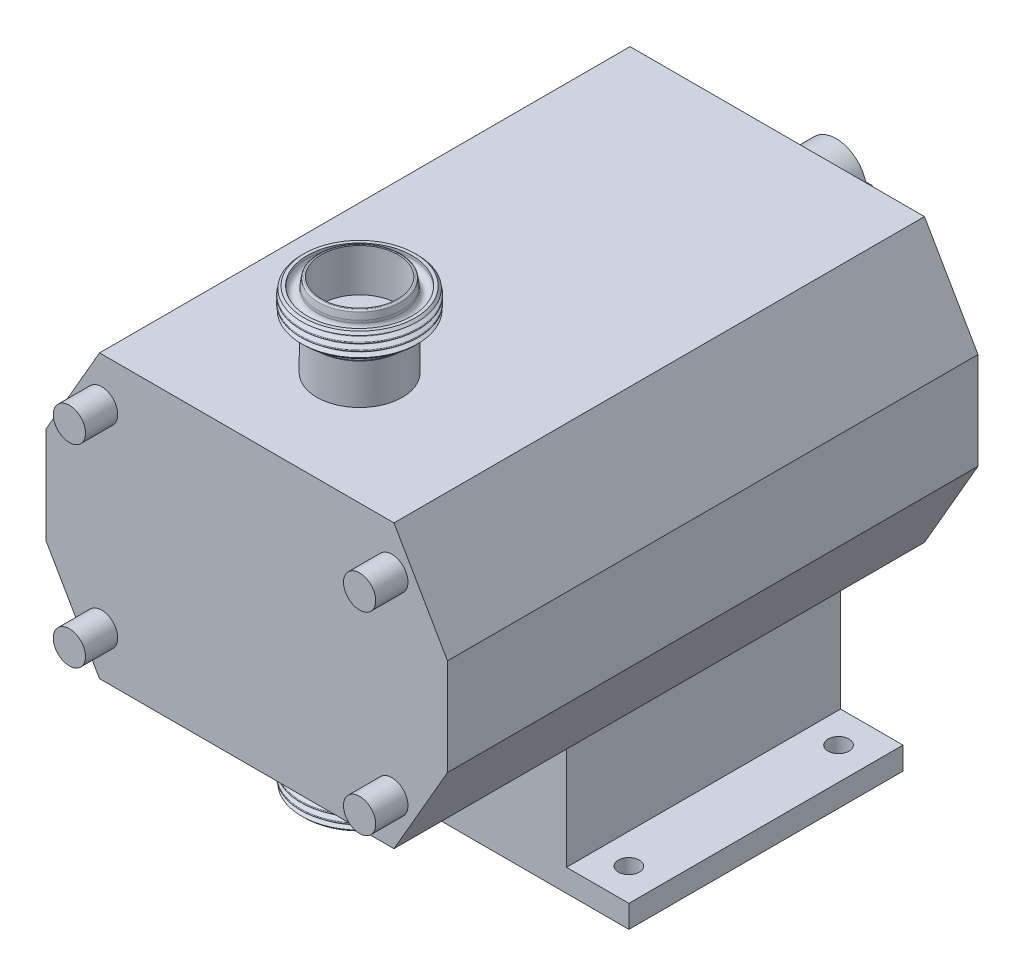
ISO-10303-21;
HEADER;
FILE_DESCRIPTION(('STEP AP214'),'2;1');
FILE_NAME('part.step','',(''),(''),'','','');
FILE_SCHEMA(('AUTOMOTIVE_DESIGN { 1 0 10303 214 1 1 1 1 }'));
ENDSEC;
DATA;
#1=APPLICATION_CONTEXT('core data for automotive mechanical design processes');
#2=APPLICATION_PROTOCOL_DEFINITION('international standard','automotive_design',2000,#1);
#3=PRODUCT_CONTEXT('',#1,'mechanical');
#4=PRODUCT('Part','Part','',(#3));
#5=PRODUCT_RELATED_PRODUCT_CATEGORY('part','',(#4));
#6=PRODUCT_DEFINITION_FORMATION('','',#4);
#7=PRODUCT_DEFINITION_CONTEXT('part definition',#1,'design');
#8=PRODUCT_DEFINITION('design','',#6,#7);
#9=PRODUCT_DEFINITION_SHAPE('','',#8);
#10=(LENGTH_UNIT() NAMED_UNIT(*) SI_UNIT(.MILLI.,.METRE.));
#11=(NAMED_UNIT(*) PLANE_ANGLE_UNIT() SI_UNIT($,.RADIAN.));
#12=(NAMED_UNIT(*) SI_UNIT($,.STERADIAN.) SOLID_ANGLE_UNIT());
#13=UNCERTAINTY_MEASURE_WITH_UNIT(LENGTH_MEASURE(1.E-05),#10,'distance_accuracy_value','');
#14=(GEOMETRIC_REPRESENTATION_CONTEXT(3) GLOBAL_UNCERTAINTY_ASSIGNED_CONTEXT((#13)) GLOBAL_UNIT_ASSIGNED_CONTEXT((#10,
#11,#12)) REPRESENTATION_CONTEXT('',''));
#15=CARTESIAN_POINT('',(0.,0.,0.));
#16=DIRECTION('',(0.,0.,1.));
#17=DIRECTION('',(1.,0.,0.));
#18=AXIS2_PLACEMENT_3D('',#15,#16,#17);
#19=CARTESIAN_POINT('',(-1.2594583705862,-115.773801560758,156.5));
#20=DIRECTION('',(0.,1.,0.));
#21=DIRECTION('',(-0.54022258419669,0.,-0.841522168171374));
#22=AXIS2_PLACEMENT_3D('',#19,#20,#21);
#23=CONICAL_SURFACE('',#22,34.5,0.785398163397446);
#24=CARTESIAN_POINT('',(-1.2594583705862,-115.773801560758,156.5));
#25=DIRECTION('',(0.,-1.,0.));
#26=DIRECTION('',(0.54022258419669,0.,0.841522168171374));
#27=AXIS2_PLACEMENT_3D('',#24,#25,#26);
#28=CIRCLE('',#27,34.5);
#29=CARTESIAN_POINT('',(17.3782207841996,-115.773801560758,185.532514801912));
#30=VERTEX_POINT('',#29);
#31=EDGE_CURVE('P0_E52',#30,#30,#28,.T.);
#32=ORIENTED_EDGE('',*,*,#31,.F.);
#33=EDGE_LOOP('',(#32));
#34=FACE_BOUND('',#33,.T.);
#35=CARTESIAN_POINT('',(-1.2594583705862,-114.378416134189,156.5));
#36=DIRECTION('',(0.,-1.,0.));
#37=DIRECTION('',(0.54022258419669,0.,0.841522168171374));
#38=AXIS2_PLACEMENT_3D('',#35,#36,#37);
#39=CIRCLE('',#38,35.8953854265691);
#40=CARTESIAN_POINT('',(18.1320395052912,-114.378416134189,186.706762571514));
#41=VERTEX_POINT('',#40);
#42=EDGE_CURVE('P0_E18',#41,#41,#39,.T.);
#43=ORIENTED_EDGE('',*,*,#42,.T.);
#44=EDGE_LOOP('',(#43));
#45=FACE_BOUND('',#44,.T.);
#46=ADVANCED_FACE('P0_F14',(#34,#45),#23,.T.);
#47=CARTESIAN_POINT('',(-1.2594583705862,-103.073801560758,156.5));
#48=DIRECTION('',(0.,-1.,0.));
#49=DIRECTION('',(0.54022258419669,0.,0.841522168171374));
#50=AXIS2_PLACEMENT_3D('',#47,#48,#49);
#51=CONICAL_SURFACE('',#50,36.5,0.785398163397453);
#52=CARTESIAN_POINT('',(-1.2594583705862,-101.073801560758,156.5));
#53=DIRECTION('',(0.,-1.,0.));
#54=DIRECTION('',(0.54022258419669,0.,0.841522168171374));
#55=AXIS2_PLACEMENT_3D('',#52,#53,#54);
#56=CIRCLE('',#55,34.5);
#57=CARTESIAN_POINT('',(17.3782207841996,-101.073801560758,185.532514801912));
#58=VERTEX_POINT('',#57);
#59=EDGE_CURVE('P0_E49',#58,#58,#56,.T.);
#60=ORIENTED_EDGE('',*,*,#59,.T.);
#61=EDGE_LOOP('',(#60));
#62=FACE_BOUND('',#61,.T.);
#63=CARTESIAN_POINT('',(-1.2594583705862,-102.711796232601,156.5));
#64=DIRECTION('',(0.,1.,0.));
#65=DIRECTION('',(-0.54022258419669,0.,-0.841522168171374));
#66=AXIS2_PLACEMENT_3D('',#63,#64,#65);
#67=CIRCLE('',#66,36.1379946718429);
#68=CARTESIAN_POINT('',(-20.7820192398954,-102.711796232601,126.089076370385));
#69=VERTEX_POINT('',#68);
#70=EDGE_CURVE('P0_E30',#69,#69,#67,.T.);
#71=ORIENTED_EDGE('',*,*,#70,.T.);
#72=EDGE_LOOP('',(#71));
#73=FACE_BOUND('',#72,.T.);
#74=ADVANCED_FACE('P0_F97',(#62,#73),#51,.T.);
#75=CARTESIAN_POINT('',(-1.2594583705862,-98.5738015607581,156.5));
#76=DIRECTION('',(0.,-1.,0.));
#77=DIRECTION('',(0.54022258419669,0.,0.841522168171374));
#78=AXIS2_PLACEMENT_3D('',#75,#76,#77);
#79=TOROIDAL_SURFACE('',#78,28.5,2.5);
#80=CARTESIAN_POINT('',(-1.2594583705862,-98.5738015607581,156.5));
#81=DIRECTION('',(0.,-1.,0.));
#82=DIRECTION('',(0.54022258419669,0.,0.841522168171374));
#83=AXIS2_PLACEMENT_3D('',#80,#81,#82);
#84=CIRCLE('',#83,26.);
#85=CARTESIAN_POINT('',(12.7863288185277,-98.5738015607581,178.379576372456));
#86=VERTEX_POINT('',#85);
#87=EDGE_CURVE('P0_E9',#86,#86,#84,.T.);
#88=ORIENTED_EDGE('',*,*,#87,.T.);
#89=EDGE_LOOP('',(#88));
#90=FACE_BOUND('',#89,.T.);
#91=CARTESIAN_POINT('',(-1.2594583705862,-101.073801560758,156.5));
#92=DIRECTION('',(0.,-1.,0.));
#93=DIRECTION('',(0.54022258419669,0.,0.841522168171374));
#94=AXIS2_PLACEMENT_3D('',#91,#92,#93);
#95=CIRCLE('',#94,28.5);
#96=CARTESIAN_POINT('',(14.1368852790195,-101.073801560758,180.483381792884));
#97=VERTEX_POINT('',#96);
#98=EDGE_CURVE('P0_E36',#97,#97,#95,.T.);
#99=ORIENTED_EDGE('',*,*,#98,.F.);
#100=EDGE_LOOP('',(#99));
#101=FACE_BOUND('',#100,.T.);
#102=ADVANCED_FACE('P0_F16',(#90,#101),#79,.F.);
#103=CARTESIAN_POINT('',(-1.2594583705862,-131.795031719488,156.5));
#104=DIRECTION('',(0.,-1.,0.));
#105=DIRECTION('',(0.54022258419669,0.,0.841522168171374));
#106=AXIS2_PLACEMENT_3D('',#103,#104,#105);
#107=CYLINDRICAL_SURFACE('',#106,26.);
#108=CARTESIAN_POINT('',(-1.2594583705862,-94.0738015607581,156.5));
#109=DIRECTION('',(0.,-1.,0.));
#110=DIRECTION('',(0.54022258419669,0.,0.841522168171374));
#111=AXIS2_PLACEMENT_3D('',#108,#109,#110);
#112=CIRCLE('',#111,26.);
#113=CARTESIAN_POINT('',(12.7863288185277,-94.0738015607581,178.379576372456));
#114=VERTEX_POINT('',#113);
#115=EDGE_CURVE('P0_E22',#114,#114,#112,.T.);
#116=ORIENTED_EDGE('',*,*,#115,.T.);
#117=EDGE_LOOP('',(#116));
#118=FACE_BOUND('',#117,.T.);
#119=ORIENTED_EDGE('',*,*,#87,.F.);
#120=EDGE_LOOP('',(#119));
#121=FACE_BOUND('',#120,.T.);
#122=ADVANCED_FACE('P0_F94',(#118,#121),#107,.T.);
#123=CARTESIAN_POINT('',(18.7687692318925,-94.0738015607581,143.642702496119));
#124=DIRECTION('',(0.,1.,0.));
#125=DIRECTION('',(-0.54022258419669,0.,-0.841522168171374));
#126=AXIS2_PLACEMENT_3D('',#123,#124,#125);
#127=PLANE('',#126);
#128=CARTESIAN_POINT('',(-1.2594583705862,-94.0738015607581,156.5));
#129=DIRECTION('',(0.,-1.,0.));
#130=DIRECTION('',(0.54022258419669,0.,0.841522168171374));
#131=AXIS2_PLACEMENT_3D('',#128,#129,#130);
#132=CIRCLE('',#131,23.8);
#133=CARTESIAN_POINT('',(11.597839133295,-94.0738015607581,176.528227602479));
#134=VERTEX_POINT('',#133);
#135=EDGE_CURVE('P0_E27',#134,#134,#132,.T.);
#136=ORIENTED_EDGE('',*,*,#135,.T.);
#137=EDGE_LOOP('',(#136));
#138=FACE_BOUND('',#137,.T.);
#139=ORIENTED_EDGE('',*,*,#115,.F.);
#140=EDGE_LOOP('',(#139));
#141=FACE_BOUND('',#140,.T.);
#142=ADVANCED_FACE('P0_F78',(#138,#141),#127,.T.);
#143=CARTESIAN_POINT('',(-1.2594583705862,-131.795031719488,156.5));
#144=DIRECTION('',(0.,-1.,0.));
#145=DIRECTION('',(0.54022258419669,0.,0.841522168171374));
#146=AXIS2_PLACEMENT_3D('',#143,#144,#145);
#147=CYLINDRICAL_SURFACE('',#146,23.8);
#148=CARTESIAN_POINT('',(-1.2594583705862,-120.573801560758,156.5));
#149=DIRECTION('',(0.,-1.,0.));
#150=DIRECTION('',(0.54022258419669,0.,0.841522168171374));
#151=AXIS2_PLACEMENT_3D('',#148,#149,#150);
#152=CIRCLE('',#151,23.8);
#153=CARTESIAN_POINT('',(11.597839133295,-120.573801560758,176.528227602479));
#154=VERTEX_POINT('',#153);
#155=EDGE_CURVE('P0_E73',#154,#154,#152,.T.);
#156=ORIENTED_EDGE('',*,*,#155,.T.);
#157=EDGE_LOOP('',(#156));
#158=FACE_BOUND('',#157,.T.);
#159=ORIENTED_EDGE('',*,*,#135,.F.);
#160=EDGE_LOOP('',(#159));
#161=FACE_BOUND('',#160,.T.);
#162=ADVANCED_FACE('P0_F81',(#158,#161),#147,.F.);
#163=CARTESIAN_POINT('',(19.417566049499,-120.573801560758,143.226201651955));
#164=DIRECTION('',(0.,-1.,0.));
#165=DIRECTION('',(0.54022258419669,0.,0.841522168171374));
#166=AXIS2_PLACEMENT_3D('',#163,#164,#165);
#167=PLANE('',#166);
#168=CARTESIAN_POINT('',(-1.2594583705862,-120.573801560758,156.5));
#169=DIRECTION('',(0.,-1.,0.));
#170=DIRECTION('',(0.54022258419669,0.,0.841522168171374));
#171=AXIS2_PLACEMENT_3D('',#168,#169,#170);
#172=CIRCLE('',#171,24.5709800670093);
#173=CARTESIAN_POINT('',(12.0143399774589,-120.573801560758,177.177024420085));
#174=VERTEX_POINT('',#173);
#175=EDGE_CURVE('P0_E70',#174,#174,#172,.T.);
#176=ORIENTED_EDGE('',*,*,#175,.T.);
#177=EDGE_LOOP('',(#176));
#178=FACE_BOUND('',#177,.T.);
#179=ORIENTED_EDGE('',*,*,#155,.F.);
#180=EDGE_LOOP('',(#179));
#181=FACE_BOUND('',#180,.T.);
#182=ADVANCED_FACE('P0_F83',(#178,#181),#167,.T.);
#183=CARTESIAN_POINT('',(-1.2594583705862,-119.573801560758,156.5));
#184=DIRECTION('',(0.,-1.,0.));
#185=DIRECTION('',(0.54022258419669,0.,0.841522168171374));
#186=AXIS2_PLACEMENT_3D('',#183,#184,#185);
#187=TOROIDAL_SURFACE('',#186,24.5709800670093,1.);
#188=CARTESIAN_POINT('',(-1.2594583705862,-119.721610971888,156.5));
#189=DIRECTION('',(0.,-1.,0.));
#190=DIRECTION('',(0.54022258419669,0.,0.841522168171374));
#191=AXIS2_PLACEMENT_3D('',#188,#189,#190);
#192=CIRCLE('',#191,25.5599959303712);
#193=CARTESIAN_POINT('',(12.5486286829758,-119.721610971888,178.009303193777));
#194=VERTEX_POINT('',#193);
#195=EDGE_CURVE('P0_E67',#194,#194,#192,.T.);
#196=ORIENTED_EDGE('',*,*,#195,.T.);
#197=EDGE_LOOP('',(#196));
#198=FACE_BOUND('',#197,.T.);
#199=ORIENTED_EDGE('',*,*,#175,.F.);
#200=EDGE_LOOP('',(#199));
#201=FACE_BOUND('',#200,.T.);
#202=ADVANCED_FACE('P0_F91',(#198,#201),#187,.T.);
#203=CARTESIAN_POINT('',(-1.2594583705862,-119.721610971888,156.5));
#204=DIRECTION('',(0.,1.,0.));
#205=DIRECTION('',(-0.54022258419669,0.,-0.841522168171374));
#206=AXIS2_PLACEMENT_3D('',#203,#204,#205);
#207=CONICAL_SURFACE('',#206,25.5599959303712,0.148352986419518);
#208=CARTESIAN_POINT('',(-1.2594583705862,-115.773801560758,156.5));
#209=DIRECTION('',(0.,-1.,0.));
#210=DIRECTION('',(0.54022258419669,0.,0.841522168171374));
#211=AXIS2_PLACEMENT_3D('',#208,#209,#210);
#212=CIRCLE('',#211,26.15);
#213=CARTESIAN_POINT('',(12.8673622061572,-115.773801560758,178.505804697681));
#214=VERTEX_POINT('',#213);
#215=EDGE_CURVE('P0_E64',#214,#214,#212,.T.);
#216=ORIENTED_EDGE('',*,*,#215,.T.);
#217=EDGE_LOOP('',(#216));
#218=FACE_BOUND('',#217,.T.);
#219=ORIENTED_EDGE('',*,*,#195,.F.);
#220=EDGE_LOOP('',(#219));
#221=FACE_BOUND('',#220,.T.);
#222=ADVANCED_FACE('P0_F125',(#218,#221),#207,.T.);
#223=CARTESIAN_POINT('',(-1.2594583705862,-131.795031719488,156.5));
#224=DIRECTION('',(0.,-1.,0.));
#225=DIRECTION('',(0.54022258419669,0.,0.841522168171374));
#226=AXIS2_PLACEMENT_3D('',#223,#224,#225);
#227=CYLINDRICAL_SURFACE('',#226,26.15);
#228=CARTESIAN_POINT('',(-1.2594583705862,-114.173801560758,156.5));
#229=DIRECTION('',(0.,-1.,0.));
#230=DIRECTION('',(0.54022258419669,0.,0.841522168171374));
#231=AXIS2_PLACEMENT_3D('',#228,#229,#230);
#232=CIRCLE('',#231,26.15);
#233=CARTESIAN_POINT('',(12.8673622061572,-114.173801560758,178.505804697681));
#234=VERTEX_POINT('',#233);
#235=EDGE_CURVE('P0_E61',#234,#234,#232,.T.);
#236=ORIENTED_EDGE('',*,*,#235,.T.);
#237=EDGE_LOOP('',(#236));
#238=FACE_BOUND('',#237,.T.);
#239=ORIENTED_EDGE('',*,*,#215,.F.);
#240=EDGE_LOOP('',(#239));
#241=FACE_BOUND('',#240,.T.);
#242=ADVANCED_FACE('P0_F121',(#238,#241),#227,.T.);
#243=CARTESIAN_POINT('',(-1.2594583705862,-114.173801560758,156.5));
#244=DIRECTION('',(0.,-1.,0.));
#245=DIRECTION('',(0.54022258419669,0.,0.841522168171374));
#246=AXIS2_PLACEMENT_3D('',#243,#244,#245);
#247=TOROIDAL_SURFACE('',#246,29.325,3.175);
#248=CARTESIAN_POINT('',(-1.2594583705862,-114.173801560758,156.5));
#249=DIRECTION('',(0.,-1.,0.));
#250=DIRECTION('',(0.54022258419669,0.,0.841522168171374));
#251=AXIS2_PLACEMENT_3D('',#248,#249,#250);
#252=CIRCLE('',#251,32.5);
#253=CARTESIAN_POINT('',(16.2977756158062,-114.173801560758,183.84947046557));
#254=VERTEX_POINT('',#253);
#255=EDGE_CURVE('P0_E58',#254,#254,#252,.T.);
#256=ORIENTED_EDGE('',*,*,#255,.T.);
#257=EDGE_LOOP('',(#256));
#258=FACE_BOUND('',#257,.T.);
#259=ORIENTED_EDGE('',*,*,#235,.F.);
#260=EDGE_LOOP('',(#259));
#261=FACE_BOUND('',#260,.T.);
#262=ADVANCED_FACE('P0_F117',(#258,#261),#247,.F.);
#263=CARTESIAN_POINT('',(-1.2594583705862,-131.795031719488,156.5));
#264=DIRECTION('',(0.,-1.,0.));
#265=DIRECTION('',(0.54022258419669,0.,0.841522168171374));
#266=AXIS2_PLACEMENT_3D('',#263,#264,#265);
#267=CYLINDRICAL_SURFACE('',#266,32.5);
#268=CARTESIAN_POINT('',(-1.2594583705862,-115.773801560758,156.5));
#269=DIRECTION('',(0.,-1.,0.));
#270=DIRECTION('',(0.54022258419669,0.,0.841522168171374));
#271=AXIS2_PLACEMENT_3D('',#268,#269,#270);
#272=CIRCLE('',#271,32.5);
#273=CARTESIAN_POINT('',(16.2977756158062,-115.773801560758,183.84947046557));
#274=VERTEX_POINT('',#273);
#275=EDGE_CURVE('P0_E55',#274,#274,#272,.T.);
#276=ORIENTED_EDGE('',*,*,#275,.T.);
#277=EDGE_LOOP('',(#276));
#278=FACE_BOUND('',#277,.T.);
#279=ORIENTED_EDGE('',*,*,#255,.F.);
#280=EDGE_LOOP('',(#279));
#281=FACE_BOUND('',#280,.T.);
#282=ADVANCED_FACE('P0_F113',(#278,#281),#267,.F.);
#283=CARTESIAN_POINT('',(27.7730564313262,-115.773801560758,137.862320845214));
#284=DIRECTION('',(0.,-1.,0.));
#285=DIRECTION('',(0.54022258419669,0.,0.841522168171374));
#286=AXIS2_PLACEMENT_3D('',#283,#284,#285);
#287=PLANE('',#286);
#288=ORIENTED_EDGE('',*,*,#31,.T.);
#289=EDGE_LOOP('',(#288));
#290=FACE_BOUND('',#289,.T.);
#291=ORIENTED_EDGE('',*,*,#275,.F.);
#292=EDGE_LOOP('',(#291));
#293=FACE_BOUND('',#292,.T.);
#294=ADVANCED_FACE('P0_F109',(#290,#293),#287,.T.);
#295=CARTESIAN_POINT('',(22.723923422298,-101.073801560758,141.103656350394));
#296=DIRECTION('',(0.,1.,0.));
#297=DIRECTION('',(-0.54022258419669,0.,-0.841522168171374));
#298=AXIS2_PLACEMENT_3D('',#295,#296,#297);
#299=PLANE('',#298);
#300=ORIENTED_EDGE('',*,*,#98,.T.);
#301=EDGE_LOOP('',(#300));
#302=FACE_BOUND('',#301,.T.);
#303=ORIENTED_EDGE('',*,*,#59,.F.);
#304=EDGE_LOOP('',(#303));
#305=FACE_BOUND('',#304,.T.);
#306=ADVANCED_FACE('P0_F112',(#302,#305),#299,.T.);
#307=CARTESIAN_POINT('',(-1.2594583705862,-110.724801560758,156.5));
#308=DIRECTION('',(0.,-1.,0.));
#309=DIRECTION('',(0.54022258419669,0.,0.841522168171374));
#310=AXIS2_PLACEMENT_3D('',#307,#308,#309);
#311=TOROIDAL_SURFACE('',#310,36.064,0.436000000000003);
#312=CARTESIAN_POINT('',(-1.2594583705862,-111.111568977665,156.5));
#313=DIRECTION('',(0.,-1.,0.));
#314=DIRECTION('',(0.54022258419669,0.,0.841522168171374));
#315=AXIS2_PLACEMENT_3D('',#312,#313,#314);
#316=CIRCLE('',#315,36.2652634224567);
#317=CARTESIAN_POINT('',(18.3318559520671,-111.111568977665,187.018023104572));
#318=VERTEX_POINT('',#317);
#319=EDGE_CURVE('P0_E43',#318,#318,#316,.T.);
#320=ORIENTED_EDGE('',*,*,#319,.F.);
#321=EDGE_LOOP('',(#320));
#322=FACE_BOUND('',#321,.T.);
#323=CARTESIAN_POINT('',(-1.2594583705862,-110.338095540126,156.5));
#324=DIRECTION('',(0.,-1.,0.));
#325=DIRECTION('',(0.54022258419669,0.,0.841522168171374));
#326=AXIS2_PLACEMENT_3D('',#323,#324,#325);
#327=CIRCLE('',#326,36.2653813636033);
#328=CARTESIAN_POINT('',(18.3319196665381,-110.338095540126,187.018122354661));
#329=VERTEX_POINT('',#328);
#330=EDGE_CURVE('P0_E284',#329,#329,#327,.T.);
#331=ORIENTED_EDGE('',*,*,#330,.T.);
#332=EDGE_LOOP('',(#331));
#333=FACE_BOUND('',#332,.T.);
#334=ADVANCED_FACE('P0_F171',(#322,#333),#311,.T.);
#335=CARTESIAN_POINT('',(-1.2594583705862,-106.491801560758,156.5));
#336=DIRECTION('',(0.,-1.,0.));
#337=DIRECTION('',(0.54022258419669,0.,0.841522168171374));
#338=AXIS2_PLACEMENT_3D('',#335,#336,#337);
#339=TOROIDAL_SURFACE('',#338,36.064,0.436000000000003);
#340=CARTESIAN_POINT('',(-1.2594583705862,-106.878568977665,156.5));
#341=DIRECTION('',(0.,-1.,0.));
#342=DIRECTION('',(0.54022258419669,0.,0.841522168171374));
#343=AXIS2_PLACEMENT_3D('',#340,#341,#342);
#344=CIRCLE('',#343,36.2652634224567);
#345=CARTESIAN_POINT('',(18.3318559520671,-106.878568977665,187.018023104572));
#346=VERTEX_POINT('',#345);
#347=EDGE_CURVE('P0_E275',#346,#346,#344,.T.);
#348=ORIENTED_EDGE('',*,*,#347,.F.);
#349=EDGE_LOOP('',(#348));
#350=FACE_BOUND('',#349,.T.);
#351=CARTESIAN_POINT('',(-1.2594583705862,-106.105095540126,156.5));
#352=DIRECTION('',(0.,-1.,0.));
#353=DIRECTION('',(0.54022258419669,0.,0.841522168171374));
#354=AXIS2_PLACEMENT_3D('',#351,#352,#353);
#355=CIRCLE('',#354,36.2653813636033);
#356=CARTESIAN_POINT('',(18.3319196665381,-106.105095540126,187.018122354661));
#357=VERTEX_POINT('',#356);
#358=EDGE_CURVE('P0_E270',#357,#357,#355,.T.);
#359=ORIENTED_EDGE('',*,*,#358,.T.);
#360=EDGE_LOOP('',(#359));
#361=FACE_BOUND('',#360,.T.);
#362=ADVANCED_FACE('P0_F178',(#350,#361),#339,.T.);
#363=CARTESIAN_POINT('',(-1.2594583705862,-114.571095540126,156.5));
#364=DIRECTION('',(0.,-1.,0.));
#365=DIRECTION('',(0.54022258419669,0.,0.841522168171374));
#366=AXIS2_PLACEMENT_3D('',#363,#364,#365);
#367=CONICAL_SURFACE('',#366,36.2653813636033,1.0906783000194);
#368=ORIENTED_EDGE('',*,*,#42,.F.);
#369=EDGE_LOOP('',(#368));
#370=FACE_BOUND('',#369,.T.);
#371=CARTESIAN_POINT('',(-1.2594583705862,-113.22750758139,156.5));
#372=DIRECTION('',(0.,-1.,0.));
#373=DIRECTION('',(0.54022258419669,0.,0.841522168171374));
#374=AXIS2_PLACEMENT_3D('',#371,#372,#373);
#375=CIRCLE('',#374,33.6853335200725);
#376=CARTESIAN_POINT('',(16.9381195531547,-113.22750758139,184.846954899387));
#377=VERTEX_POINT('',#376);
#378=EDGE_CURVE('P0_E32',#377,#377,#375,.T.);
#379=ORIENTED_EDGE('',*,*,#378,.T.);
#380=EDGE_LOOP('',(#379));
#381=FACE_BOUND('',#380,.T.);
#382=ADVANCED_FACE('P0_F186',(#370,#381),#367,.T.);
#383=CARTESIAN_POINT('',(-1.2594583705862,-112.840801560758,156.5));
#384=DIRECTION('',(0.,-1.,0.));
#385=DIRECTION('',(0.54022258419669,0.,0.841522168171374));
#386=AXIS2_PLACEMENT_3D('',#383,#384,#385);
#387=TOROIDAL_SURFACE('',#386,33.8867148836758,0.435999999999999);
#388=CARTESIAN_POINT('',(-1.2594583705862,-112.454034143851,156.5));
#389=DIRECTION('',(0.,-1.,0.));
#390=DIRECTION('',(0.54022258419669,0.,0.841522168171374));
#391=AXIS2_PLACEMENT_3D('',#388,#389,#390);
#392=CIRCLE('',#391,33.6854514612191);
#393=CARTESIAN_POINT('',(16.9381832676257,-112.454034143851,184.847054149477));
#394=VERTEX_POINT('',#393);
#395=EDGE_CURVE('P0_E38',#394,#394,#392,.T.);
#396=ORIENTED_EDGE('',*,*,#395,.T.);
#397=EDGE_LOOP('',(#396));
#398=FACE_BOUND('',#397,.T.);
#399=ORIENTED_EDGE('',*,*,#378,.F.);
#400=EDGE_LOOP('',(#399));
#401=FACE_BOUND('',#400,.T.);
#402=ADVANCED_FACE('P0_F194',(#398,#401),#387,.F.);
#403=CARTESIAN_POINT('',(-1.2594583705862,-112.454034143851,156.5));
#404=DIRECTION('',(0.,1.,0.));
#405=DIRECTION('',(-0.54022258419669,0.,-0.841522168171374));
#406=AXIS2_PLACEMENT_3D('',#403,#404,#405);
#407=CONICAL_SURFACE('',#406,33.6854514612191,1.09098326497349);
#408=ORIENTED_EDGE('',*,*,#319,.T.);
#409=EDGE_LOOP('',(#408));
#410=FACE_BOUND('',#409,.T.);
#411=ORIENTED_EDGE('',*,*,#395,.F.);
#412=EDGE_LOOP('',(#411));
#413=FACE_BOUND('',#412,.T.);
#414=ADVANCED_FACE('P0_F202',(#410,#413),#407,.T.);
#415=CARTESIAN_POINT('',(-1.2594583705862,-110.338095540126,156.5));
#416=DIRECTION('',(0.,-1.,0.));
#417=DIRECTION('',(0.54022258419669,0.,0.841522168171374));
#418=AXIS2_PLACEMENT_3D('',#415,#416,#417);
#419=CONICAL_SURFACE('',#418,36.2653813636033,1.0906783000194);
#420=CARTESIAN_POINT('',(-1.2594583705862,-108.99450758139,156.5));
#421=DIRECTION('',(0.,-1.,0.));
#422=DIRECTION('',(0.54022258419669,0.,0.841522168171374));
#423=AXIS2_PLACEMENT_3D('',#420,#421,#422);
#424=CIRCLE('',#423,33.6853335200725);
#425=CARTESIAN_POINT('',(16.9381195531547,-108.99450758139,184.846954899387));
#426=VERTEX_POINT('',#425);
#427=EDGE_CURVE('P0_E281',#426,#426,#424,.T.);
#428=ORIENTED_EDGE('',*,*,#427,.T.);
#429=EDGE_LOOP('',(#428));
#430=FACE_BOUND('',#429,.T.);
#431=ORIENTED_EDGE('',*,*,#330,.F.);
#432=EDGE_LOOP('',(#431));
#433=FACE_BOUND('',#432,.T.);
#434=ADVANCED_FACE('P0_F210',(#430,#433),#419,.T.);
#435=CARTESIAN_POINT('',(-1.2594583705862,-108.607801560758,156.5));
#436=DIRECTION('',(0.,-1.,0.));
#437=DIRECTION('',(0.54022258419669,0.,0.841522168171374));
#438=AXIS2_PLACEMENT_3D('',#435,#436,#437);
#439=TOROIDAL_SURFACE('',#438,33.8867148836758,0.435999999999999);
#440=CARTESIAN_POINT('',(-1.2594583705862,-108.221034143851,156.5));
#441=DIRECTION('',(0.,-1.,0.));
#442=DIRECTION('',(0.54022258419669,0.,0.841522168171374));
#443=AXIS2_PLACEMENT_3D('',#440,#441,#442);
#444=CIRCLE('',#443,33.6854514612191);
#445=CARTESIAN_POINT('',(16.9381832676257,-108.221034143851,184.847054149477));
#446=VERTEX_POINT('',#445);
#447=EDGE_CURVE('P0_E278',#446,#446,#444,.T.);
#448=ORIENTED_EDGE('',*,*,#447,.T.);
#449=EDGE_LOOP('',(#448));
#450=FACE_BOUND('',#449,.T.);
#451=ORIENTED_EDGE('',*,*,#427,.F.);
#452=EDGE_LOOP('',(#451));
#453=FACE_BOUND('',#452,.T.);
#454=ADVANCED_FACE('P0_F218',(#450,#453),#439,.F.);
#455=CARTESIAN_POINT('',(-1.2594583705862,-108.221034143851,156.5));
#456=DIRECTION('',(0.,1.,0.));
#457=DIRECTION('',(-0.54022258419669,0.,-0.841522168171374));
#458=AXIS2_PLACEMENT_3D('',#455,#456,#457);
#459=CONICAL_SURFACE('',#458,33.6854514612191,1.09098326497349);
#460=ORIENTED_EDGE('',*,*,#347,.T.);
#461=EDGE_LOOP('',(#460));
#462=FACE_BOUND('',#461,.T.);
#463=ORIENTED_EDGE('',*,*,#447,.F.);
#464=EDGE_LOOP('',(#463));
#465=FACE_BOUND('',#464,.T.);
#466=ADVANCED_FACE('P0_F226',(#462,#465),#459,.T.);
#467=CARTESIAN_POINT('',(-1.2594583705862,-106.105095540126,156.5));
#468=DIRECTION('',(0.,-1.,0.));
#469=DIRECTION('',(0.54022258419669,0.,0.841522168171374));
#470=AXIS2_PLACEMENT_3D('',#467,#468,#469);
#471=CONICAL_SURFACE('',#470,36.2653813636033,1.0906783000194);
#472=CARTESIAN_POINT('',(-1.2594583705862,-104.76150758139,156.5));
#473=DIRECTION('',(0.,-1.,0.));
#474=DIRECTION('',(0.54022258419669,0.,0.841522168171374));
#475=AXIS2_PLACEMENT_3D('',#472,#473,#474);
#476=CIRCLE('',#475,33.6853335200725);
#477=CARTESIAN_POINT('',(16.9381195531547,-104.76150758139,184.846954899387));
#478=VERTEX_POINT('',#477);
#479=EDGE_CURVE('P0_E267',#478,#478,#476,.T.);
#480=ORIENTED_EDGE('',*,*,#479,.T.);
#481=EDGE_LOOP('',(#480));
#482=FACE_BOUND('',#481,.T.);
#483=ORIENTED_EDGE('',*,*,#358,.F.);
#484=EDGE_LOOP('',(#483));
#485=FACE_BOUND('',#484,.T.);
#486=ADVANCED_FACE('P0_F234',(#482,#485),#471,.T.);
#487=CARTESIAN_POINT('',(-1.2594583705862,-104.374801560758,156.5));
#488=DIRECTION('',(0.,-1.,0.));
#489=DIRECTION('',(0.54022258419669,0.,0.841522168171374));
#490=AXIS2_PLACEMENT_3D('',#487,#488,#489);
#491=TOROIDAL_SURFACE('',#490,33.8867148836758,0.435999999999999);
#492=CARTESIAN_POINT('',(-1.2594583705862,-103.988034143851,156.5));
#493=DIRECTION('',(0.,-1.,0.));
#494=DIRECTION('',(0.54022258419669,0.,0.841522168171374));
#495=AXIS2_PLACEMENT_3D('',#492,#493,#494);
#496=CIRCLE('',#495,33.6854514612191);
#497=CARTESIAN_POINT('',(16.9381832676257,-103.988034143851,184.847054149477));
#498=VERTEX_POINT('',#497);
#499=EDGE_CURVE('P0_E266',#498,#498,#496,.T.);
#500=ORIENTED_EDGE('',*,*,#499,.T.);
#501=EDGE_LOOP('',(#500));
#502=FACE_BOUND('',#501,.T.);
#503=ORIENTED_EDGE('',*,*,#479,.F.);
#504=EDGE_LOOP('',(#503));
#505=FACE_BOUND('',#504,.T.);
#506=ADVANCED_FACE('P0_F242',(#502,#505),#491,.F.);
#507=CARTESIAN_POINT('',(-1.2594583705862,-103.988034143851,156.5));
#508=DIRECTION('',(0.,1.,0.));
#509=DIRECTION('',(-0.54022258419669,0.,-0.841522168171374));
#510=AXIS2_PLACEMENT_3D('',#507,#508,#509);
#511=CONICAL_SURFACE('',#510,33.6854514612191,1.09098326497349);
#512=ORIENTED_EDGE('',*,*,#70,.F.);
#513=EDGE_LOOP('',(#512));
#514=FACE_BOUND('',#513,.T.);
#515=ORIENTED_EDGE('',*,*,#499,.F.);
#516=EDGE_LOOP('',(#515));
#517=FACE_BOUND('',#516,.T.);
#518=ADVANCED_FACE('P0_F250',(#514,#517),#511,.T.);
#519=CLOSED_SHELL('',(#46,#74,#102,#122,#142,#162,#182,#202,#222,#242,#262,#282,#294,#306,#334,
#362,#382,#402,#414,#434,#454,#466,#486,#506,#518));
#520=MANIFOLD_SOLID_BREP('P0_B1',#519);
#521=CARTESIAN_POINT('',(-1.2594583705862,152.626198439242,156.5));
#522=DIRECTION('',(0.,-1.,0.));
#523=DIRECTION('',(0.915109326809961,0.,-0.40320580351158));
#524=AXIS2_PLACEMENT_3D('',#521,#522,#523);
#525=CONICAL_SURFACE('',#524,34.5,0.785398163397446);
#526=CARTESIAN_POINT('',(-1.2594583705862,152.626198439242,156.5));
#527=DIRECTION('',(0.,1.,0.));
#528=DIRECTION('',(-0.915109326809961,0.,0.40320580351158));
#529=AXIS2_PLACEMENT_3D('',#526,#527,#528);
#530=CIRCLE('',#529,34.5);
#531=CARTESIAN_POINT('',(-32.8307301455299,152.626198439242,170.41060022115));
#532=VERTEX_POINT('',#531);
#533=EDGE_CURVE('P1_E53',#532,#532,#530,.T.);
#534=ORIENTED_EDGE('',*,*,#533,.F.);
#535=EDGE_LOOP('',(#534));
#536=FACE_BOUND('',#535,.T.);
#537=CARTESIAN_POINT('',(-1.2594583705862,151.230813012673,156.5));
#538=DIRECTION('',(0.,1.,0.));
#539=DIRECTION('',(-0.915109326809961,0.,0.40320580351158));
#540=AXIS2_PLACEMENT_3D('',#537,#538,#539);
#541=CIRCLE('',#540,35.8953854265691);
#542=CARTESIAN_POINT('',(-34.107660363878,151.230813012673,170.973227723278));
#543=VERTEX_POINT('',#542);
#544=EDGE_CURVE('P1_E19',#543,#543,#541,.T.);
#545=ORIENTED_EDGE('',*,*,#544,.T.);
#546=EDGE_LOOP('',(#545));
#547=FACE_BOUND('',#546,.T.);
#548=ADVANCED_FACE('P1_F15',(#536,#547),#525,.T.);
#549=CARTESIAN_POINT('',(-1.2594583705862,139.926198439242,156.5));
#550=DIRECTION('',(0.,1.,0.));
#551=DIRECTION('',(-0.915109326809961,0.,0.40320580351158));
#552=AXIS2_PLACEMENT_3D('',#549,#550,#551);
#553=CONICAL_SURFACE('',#552,36.5,0.785398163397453);
#554=CARTESIAN_POINT('',(-1.2594583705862,137.926198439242,156.5));
#555=DIRECTION('',(0.,1.,0.));
#556=DIRECTION('',(-0.915109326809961,0.,0.40320580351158));
#557=AXIS2_PLACEMENT_3D('',#554,#555,#556);
#558=CIRCLE('',#557,34.5);
#559=CARTESIAN_POINT('',(-32.8307301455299,137.926198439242,170.41060022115));
#560=VERTEX_POINT('',#559);
#561=EDGE_CURVE('P1_E50',#560,#560,#558,.T.);
#562=ORIENTED_EDGE('',*,*,#561,.T.);
#563=EDGE_LOOP('',(#562));
#564=FACE_BOUND('',#563,.T.);
#565=CARTESIAN_POINT('',(-1.2594583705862,139.564193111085,156.5));
#566=DIRECTION('',(0.,-1.,0.));
#567=DIRECTION('',(0.915109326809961,0.,-0.40320580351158));
#568=AXIS2_PLACEMENT_3D('',#565,#566,#567);
#569=CIRCLE('',#568,36.1379946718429);
#570=CARTESIAN_POINT('',(31.8107576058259,139.564193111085,141.928950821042));
#571=VERTEX_POINT('',#570);
#572=EDGE_CURVE('P1_E31',#571,#571,#569,.T.);
#573=ORIENTED_EDGE('',*,*,#572,.T.);
#574=EDGE_LOOP('',(#573));
#575=FACE_BOUND('',#574,.T.);
#576=ADVANCED_FACE('P1_F98',(#564,#575),#553,.T.);
#577=CARTESIAN_POINT('',(-1.2594583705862,135.426198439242,156.5));
#578=DIRECTION('',(0.,1.,0.));
#579=DIRECTION('',(-0.915109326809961,0.,0.40320580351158));
#580=AXIS2_PLACEMENT_3D('',#577,#578,#579);
#581=TOROIDAL_SURFACE('',#580,28.5,2.5);
#582=CARTESIAN_POINT('',(-1.2594583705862,135.426198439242,156.5));
#583=DIRECTION('',(0.,1.,0.));
#584=DIRECTION('',(-0.915109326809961,0.,0.40320580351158));
#585=AXIS2_PLACEMENT_3D('',#582,#583,#584);
#586=CIRCLE('',#585,26.);
#587=CARTESIAN_POINT('',(-25.0523008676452,135.426198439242,166.983350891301));
#588=VERTEX_POINT('',#587);
#589=EDGE_CURVE('P1_E10',#588,#588,#586,.T.);
#590=ORIENTED_EDGE('',*,*,#589,.T.);
#591=EDGE_LOOP('',(#590));
#592=FACE_BOUND('',#591,.T.);
#593=CARTESIAN_POINT('',(-1.2594583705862,137.926198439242,156.5));
#594=DIRECTION('',(0.,1.,0.));
#595=DIRECTION('',(-0.915109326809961,0.,0.40320580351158));
#596=AXIS2_PLACEMENT_3D('',#593,#594,#595);
#597=CIRCLE('',#596,28.5);
#598=CARTESIAN_POINT('',(-27.3400741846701,137.926198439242,167.99136540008));
#599=VERTEX_POINT('',#598);
#600=EDGE_CURVE('P1_E37',#599,#599,#597,.T.);
#601=ORIENTED_EDGE('',*,*,#600,.F.);
#602=EDGE_LOOP('',(#601));
#603=FACE_BOUND('',#602,.T.);
#604=ADVANCED_FACE('P1_F17',(#592,#603),#581,.F.);
#605=CARTESIAN_POINT('',(-1.2594583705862,168.647428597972,156.5));
#606=DIRECTION('',(0.,1.,0.));
#607=DIRECTION('',(-0.915109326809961,0.,0.40320580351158));
#608=AXIS2_PLACEMENT_3D('',#605,#606,#607);
#609=CYLINDRICAL_SURFACE('',#608,26.);
#610=CARTESIAN_POINT('',(-1.2594583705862,130.926198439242,156.5));
#611=DIRECTION('',(0.,1.,0.));
#612=DIRECTION('',(-0.915109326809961,0.,0.40320580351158));
#613=AXIS2_PLACEMENT_3D('',#610,#611,#612);
#614=CIRCLE('',#613,26.);
#615=CARTESIAN_POINT('',(-25.0523008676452,130.926198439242,166.983350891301));
#616=VERTEX_POINT('',#615);
#617=EDGE_CURVE('P1_E23',#616,#616,#614,.T.);
#618=ORIENTED_EDGE('',*,*,#617,.T.);
#619=EDGE_LOOP('',(#618));
#620=FACE_BOUND('',#619,.T.);
#621=ORIENTED_EDGE('',*,*,#589,.F.);
#622=EDGE_LOOP('',(#621));
#623=FACE_BOUND('',#622,.T.);
#624=ADVANCED_FACE('P1_F95',(#620,#623),#609,.T.);
#625=CARTESIAN_POINT('',(-10.8557564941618,130.926198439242,134.720398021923));
#626=DIRECTION('',(0.,-1.,0.));
#627=DIRECTION('',(0.915109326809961,0.,-0.40320580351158));
#628=AXIS2_PLACEMENT_3D('',#625,#626,#627);
#629=PLANE('',#628);
#630=CARTESIAN_POINT('',(-1.2594583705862,130.926198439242,156.5));
#631=DIRECTION('',(0.,1.,0.));
#632=DIRECTION('',(-0.915109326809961,0.,0.40320580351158));
#633=AXIS2_PLACEMENT_3D('',#630,#631,#632);
#634=CIRCLE('',#633,23.8);
#635=CARTESIAN_POINT('',(-23.0390603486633,130.926198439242,166.096298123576));
#636=VERTEX_POINT('',#635);
#637=EDGE_CURVE('P1_E28',#636,#636,#634,.T.);
#638=ORIENTED_EDGE('',*,*,#637,.T.);
#639=EDGE_LOOP('',(#638));
#640=FACE_BOUND('',#639,.T.);
#641=ORIENTED_EDGE('',*,*,#617,.F.);
#642=EDGE_LOOP('',(#641));
#643=FACE_BOUND('',#642,.T.);
#644=ADVANCED_FACE('P1_F79',(#640,#643),#629,.T.);
#645=CARTESIAN_POINT('',(-1.2594583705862,168.647428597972,156.5));
#646=DIRECTION('',(0.,1.,0.));
#647=DIRECTION('',(-0.915109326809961,0.,0.40320580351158));
#648=AXIS2_PLACEMENT_3D('',#645,#646,#647);
#649=CYLINDRICAL_SURFACE('',#648,23.8);
#650=CARTESIAN_POINT('',(-1.2594583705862,157.426198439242,156.5));
#651=DIRECTION('',(0.,1.,0.));
#652=DIRECTION('',(-0.915109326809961,0.,0.40320580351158));
#653=AXIS2_PLACEMENT_3D('',#650,#651,#652);
#654=CIRCLE('',#653,23.8);
#655=CARTESIAN_POINT('',(-23.0390603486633,157.426198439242,166.096298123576));
#656=VERTEX_POINT('',#655);
#657=EDGE_CURVE('P1_E74',#656,#656,#654,.T.);
#658=ORIENTED_EDGE('',*,*,#657,.T.);
#659=EDGE_LOOP('',(#658));
#660=FACE_BOUND('',#659,.T.);
#661=ORIENTED_EDGE('',*,*,#637,.F.);
#662=EDGE_LOOP('',(#661));
#663=FACE_BOUND('',#662,.T.);
#664=ADVANCED_FACE('P1_F82',(#660,#663),#649,.F.);
#665=CARTESIAN_POINT('',(-11.1666201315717,157.426198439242,134.014866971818));
#666=DIRECTION('',(0.,1.,0.));
#667=DIRECTION('',(-0.915109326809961,0.,0.40320580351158));
#668=AXIS2_PLACEMENT_3D('',#665,#666,#667);
#669=PLANE('',#668);
#670=CARTESIAN_POINT('',(-1.2594583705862,157.426198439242,156.5));
#671=DIRECTION('',(0.,1.,0.));
#672=DIRECTION('',(-0.915109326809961,0.,0.40320580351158));
#673=AXIS2_PLACEMENT_3D('',#670,#671,#672);
#674=CIRCLE('',#673,24.5709800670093);
#675=CARTESIAN_POINT('',(-23.744591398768,157.426198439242,166.407161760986));
#676=VERTEX_POINT('',#675);
#677=EDGE_CURVE('P1_E71',#676,#676,#674,.T.);
#678=ORIENTED_EDGE('',*,*,#677,.T.);
#679=EDGE_LOOP('',(#678));
#680=FACE_BOUND('',#679,.T.);
#681=ORIENTED_EDGE('',*,*,#657,.F.);
#682=EDGE_LOOP('',(#681));
#683=FACE_BOUND('',#682,.T.);
#684=ADVANCED_FACE('P1_F84',(#680,#683),#669,.T.);
#685=CARTESIAN_POINT('',(-1.2594583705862,156.426198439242,156.5));
#686=DIRECTION('',(0.,1.,0.));
#687=DIRECTION('',(-0.915109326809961,0.,0.40320580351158));
#688=AXIS2_PLACEMENT_3D('',#685,#686,#687);
#689=TOROIDAL_SURFACE('',#688,24.5709800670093,1.);
#690=CARTESIAN_POINT('',(-1.2594583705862,156.574007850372,156.5));
#691=DIRECTION('',(0.,1.,0.));
#692=DIRECTION('',(-0.915109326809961,0.,0.40320580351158));
#693=AXIS2_PLACEMENT_3D('',#690,#691,#692);
#694=CIRCLE('',#693,25.5599959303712);
#695=CARTESIAN_POINT('',(-24.6496490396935,156.574007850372,166.805938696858));
#696=VERTEX_POINT('',#695);
#697=EDGE_CURVE('P1_E68',#696,#696,#694,.T.);
#698=ORIENTED_EDGE('',*,*,#697,.T.);
#699=EDGE_LOOP('',(#698));
#700=FACE_BOUND('',#699,.T.);
#701=ORIENTED_EDGE('',*,*,#677,.F.);
#702=EDGE_LOOP('',(#701));
#703=FACE_BOUND('',#702,.T.);
#704=ADVANCED_FACE('P1_F92',(#700,#703),#689,.T.);
#705=CARTESIAN_POINT('',(-1.2594583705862,156.574007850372,156.5));
#706=DIRECTION('',(0.,-1.,0.));
#707=DIRECTION('',(0.915109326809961,0.,-0.40320580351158));
#708=AXIS2_PLACEMENT_3D('',#705,#706,#707);
#709=CONICAL_SURFACE('',#708,25.5599959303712,0.148352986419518);
#710=CARTESIAN_POINT('',(-1.2594583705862,152.626198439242,156.5));
#711=DIRECTION('',(0.,1.,0.));
#712=DIRECTION('',(-0.915109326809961,0.,0.40320580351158));
#713=AXIS2_PLACEMENT_3D('',#710,#711,#712);
#714=CIRCLE('',#713,26.15);
#715=CARTESIAN_POINT('',(-25.1895672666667,152.626198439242,167.043831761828));
#716=VERTEX_POINT('',#715);
#717=EDGE_CURVE('P1_E65',#716,#716,#714,.T.);
#718=ORIENTED_EDGE('',*,*,#717,.T.);
#719=EDGE_LOOP('',(#718));
#720=FACE_BOUND('',#719,.T.);
#721=ORIENTED_EDGE('',*,*,#697,.F.);
#722=EDGE_LOOP('',(#721));
#723=FACE_BOUND('',#722,.T.);
#724=ADVANCED_FACE('P1_F126',(#720,#723),#709,.T.);
#725=CARTESIAN_POINT('',(-1.2594583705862,168.647428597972,156.5));
#726=DIRECTION('',(0.,1.,0.));
#727=DIRECTION('',(-0.915109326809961,0.,0.40320580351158));
#728=AXIS2_PLACEMENT_3D('',#725,#726,#727);
#729=CYLINDRICAL_SURFACE('',#728,26.15);
#730=CARTESIAN_POINT('',(-1.2594583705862,151.026198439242,156.5));
#731=DIRECTION('',(0.,1.,0.));
#732=DIRECTION('',(-0.915109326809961,0.,0.40320580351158));
#733=AXIS2_PLACEMENT_3D('',#730,#731,#732);
#734=CIRCLE('',#733,26.15);
#735=CARTESIAN_POINT('',(-25.1895672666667,151.026198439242,167.043831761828));
#736=VERTEX_POINT('',#735);
#737=EDGE_CURVE('P1_E62',#736,#736,#734,.T.);
#738=ORIENTED_EDGE('',*,*,#737,.T.);
#739=EDGE_LOOP('',(#738));
#740=FACE_BOUND('',#739,.T.);
#741=ORIENTED_EDGE('',*,*,#717,.F.);
#742=EDGE_LOOP('',(#741));
#743=FACE_BOUND('',#742,.T.);
#744=ADVANCED_FACE('P1_F122',(#740,#743),#729,.T.);
#745=CARTESIAN_POINT('',(-1.2594583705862,151.026198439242,156.5));
#746=DIRECTION('',(0.,1.,0.));
#747=DIRECTION('',(-0.915109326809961,0.,0.40320580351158));
#748=AXIS2_PLACEMENT_3D('',#745,#746,#747);
#749=TOROIDAL_SURFACE('',#748,29.325,3.175);
#750=CARTESIAN_POINT('',(-1.2594583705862,151.026198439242,156.5));
#751=DIRECTION('',(0.,1.,0.));
#752=DIRECTION('',(-0.915109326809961,0.,0.40320580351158));
#753=AXIS2_PLACEMENT_3D('',#750,#751,#752);
#754=CIRCLE('',#753,32.5);
#755=CARTESIAN_POINT('',(-31.0005114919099,151.026198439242,169.604188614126));
#756=VERTEX_POINT('',#755);
#757=EDGE_CURVE('P1_E59',#756,#756,#754,.T.);
#758=ORIENTED_EDGE('',*,*,#757,.T.);
#759=EDGE_LOOP('',(#758));
#760=FACE_BOUND('',#759,.T.);
#761=ORIENTED_EDGE('',*,*,#737,.F.);
#762=EDGE_LOOP('',(#761));
#763=FACE_BOUND('',#762,.T.);
#764=ADVANCED_FACE('P1_F118',(#760,#763),#749,.F.);
#765=CARTESIAN_POINT('',(-1.2594583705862,168.647428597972,156.5));
#766=DIRECTION('',(0.,1.,0.));
#767=DIRECTION('',(-0.915109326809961,0.,0.40320580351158));
#768=AXIS2_PLACEMENT_3D('',#765,#766,#767);
#769=CYLINDRICAL_SURFACE('',#768,32.5);
#770=CARTESIAN_POINT('',(-1.2594583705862,152.626198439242,156.5));
#771=DIRECTION('',(0.,1.,0.));
#772=DIRECTION('',(-0.915109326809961,0.,0.40320580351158));
#773=AXIS2_PLACEMENT_3D('',#770,#771,#772);
#774=CIRCLE('',#773,32.5);
#775=CARTESIAN_POINT('',(-31.0005114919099,152.626198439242,169.604188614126));
#776=VERTEX_POINT('',#775);
#777=EDGE_CURVE('P1_E56',#776,#776,#774,.T.);
#778=ORIENTED_EDGE('',*,*,#777,.T.);
#779=EDGE_LOOP('',(#778));
#780=FACE_BOUND('',#779,.T.);
#781=ORIENTED_EDGE('',*,*,#757,.F.);
#782=EDGE_LOOP('',(#781));
#783=FACE_BOUND('',#782,.T.);
#784=ADVANCED_FACE('P1_F114',(#780,#783),#769,.F.);
#785=CARTESIAN_POINT('',(-15.1700585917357,152.626198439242,124.928728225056));
#786=DIRECTION('',(0.,1.,0.));
#787=DIRECTION('',(-0.915109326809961,0.,0.40320580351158));
#788=AXIS2_PLACEMENT_3D('',#785,#786,#787);
#789=PLANE('',#788);
#790=ORIENTED_EDGE('',*,*,#533,.T.);
#791=EDGE_LOOP('',(#790));
#792=FACE_BOUND('',#791,.T.);
#793=ORIENTED_EDGE('',*,*,#777,.F.);
#794=EDGE_LOOP('',(#793));
#795=FACE_BOUND('',#794,.T.);
#796=ADVANCED_FACE('P1_F110',(#792,#795),#789,.T.);
#797=CARTESIAN_POINT('',(-12.7508237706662,137.926198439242,130.419384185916));
#798=DIRECTION('',(0.,-1.,0.));
#799=DIRECTION('',(0.915109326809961,0.,-0.40320580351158));
#800=AXIS2_PLACEMENT_3D('',#797,#798,#799);
#801=PLANE('',#800);
#802=ORIENTED_EDGE('',*,*,#600,.T.);
#803=EDGE_LOOP('',(#802));
#804=FACE_BOUND('',#803,.T.);
#805=ORIENTED_EDGE('',*,*,#561,.F.);
#806=EDGE_LOOP('',(#805));
#807=FACE_BOUND('',#806,.T.);
#808=ADVANCED_FACE('P1_F113',(#804,#807),#801,.T.);
#809=CARTESIAN_POINT('',(-1.2594583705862,147.577198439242,156.5));
#810=DIRECTION('',(0.,1.,0.));
#811=DIRECTION('',(-0.915109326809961,0.,0.40320580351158));
#812=AXIS2_PLACEMENT_3D('',#809,#810,#811);
#813=TOROIDAL_SURFACE('',#812,36.064,0.436000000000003);
#814=CARTESIAN_POINT('',(-1.2594583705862,147.963965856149,156.5));
#815=DIRECTION('',(0.,1.,0.));
#816=DIRECTION('',(-0.915109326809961,0.,0.40320580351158));
#817=AXIS2_PLACEMENT_3D('',#814,#815,#816);
#818=CIRCLE('',#817,36.2652634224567);
#819=CARTESIAN_POINT('',(-34.4461391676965,147.963965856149,171.122364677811));
#820=VERTEX_POINT('',#819);
#821=EDGE_CURVE('P1_E44',#820,#820,#818,.T.);
#822=ORIENTED_EDGE('',*,*,#821,.F.);
#823=EDGE_LOOP('',(#822));
#824=FACE_BOUND('',#823,.T.);
#825=CARTESIAN_POINT('',(-1.2594583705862,147.19049241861,156.5));
#826=DIRECTION('',(0.,1.,0.));
#827=DIRECTION('',(-0.915109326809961,0.,0.40320580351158));
#828=AXIS2_PLACEMENT_3D('',#825,#826,#827);
#829=CIRCLE('',#828,36.2653813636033);
#830=CARTESIAN_POINT('',(-34.4462470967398,147.19049241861,171.122412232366));
#831=VERTEX_POINT('',#830);
#832=EDGE_CURVE('P1_E285',#831,#831,#829,.T.);
#833=ORIENTED_EDGE('',*,*,#832,.T.);
#834=EDGE_LOOP('',(#833));
#835=FACE_BOUND('',#834,.T.);
#836=ADVANCED_FACE('P1_F172',(#824,#835),#813,.T.);
#837=CARTESIAN_POINT('',(-1.2594583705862,143.344198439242,156.5));
#838=DIRECTION('',(0.,1.,0.));
#839=DIRECTION('',(-0.915109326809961,0.,0.40320580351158));
#840=AXIS2_PLACEMENT_3D('',#837,#838,#839);
#841=TOROIDAL_SURFACE('',#840,36.064,0.436000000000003);
#842=CARTESIAN_POINT('',(-1.2594583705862,143.730965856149,156.5));
#843=DIRECTION('',(0.,1.,0.));
#844=DIRECTION('',(-0.915109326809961,0.,0.40320580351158));
#845=AXIS2_PLACEMENT_3D('',#842,#843,#844);
#846=CIRCLE('',#845,36.2652634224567);
#847=CARTESIAN_POINT('',(-34.4461391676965,143.730965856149,171.122364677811));
#848=VERTEX_POINT('',#847);
#849=EDGE_CURVE('P1_E276',#848,#848,#846,.T.);
#850=ORIENTED_EDGE('',*,*,#849,.F.);
#851=EDGE_LOOP('',(#850));
#852=FACE_BOUND('',#851,.T.);
#853=CARTESIAN_POINT('',(-1.2594583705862,142.95749241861,156.5));
#854=DIRECTION('',(0.,1.,0.));
#855=DIRECTION('',(-0.915109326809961,0.,0.40320580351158));
#856=AXIS2_PLACEMENT_3D('',#853,#854,#855);
#857=CIRCLE('',#856,36.2653813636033);
#858=CARTESIAN_POINT('',(-34.4462470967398,142.95749241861,171.122412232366));
#859=VERTEX_POINT('',#858);
#860=EDGE_CURVE('P1_E271',#859,#859,#857,.T.);
#861=ORIENTED_EDGE('',*,*,#860,.T.);
#862=EDGE_LOOP('',(#861));
#863=FACE_BOUND('',#862,.T.);
#864=ADVANCED_FACE('P1_F179',(#852,#863),#841,.T.);
#865=CARTESIAN_POINT('',(-1.2594583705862,151.42349241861,156.5));
#866=DIRECTION('',(0.,1.,0.));
#867=DIRECTION('',(-0.915109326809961,0.,0.40320580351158));
#868=AXIS2_PLACEMENT_3D('',#865,#866,#867);
#869=CONICAL_SURFACE('',#868,36.2653813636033,1.0906783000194);
#870=ORIENTED_EDGE('',*,*,#544,.F.);
#871=EDGE_LOOP('',(#870));
#872=FACE_BOUND('',#871,.T.);
#873=CARTESIAN_POINT('',(-1.2594583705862,150.079904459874,156.5));
#874=DIRECTION('',(0.,1.,0.));
#875=DIRECTION('',(-0.915109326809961,0.,0.40320580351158));
#876=AXIS2_PLACEMENT_3D('',#873,#874,#875);
#877=CIRCLE('',#876,33.6853335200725);
#878=CARTESIAN_POINT('',(-32.0852212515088,150.079904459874,170.082121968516));
#879=VERTEX_POINT('',#878);
#880=EDGE_CURVE('P1_E33',#879,#879,#877,.T.);
#881=ORIENTED_EDGE('',*,*,#880,.T.);
#882=EDGE_LOOP('',(#881));
#883=FACE_BOUND('',#882,.T.);
#884=ADVANCED_FACE('P1_F187',(#872,#883),#869,.T.);
#885=CARTESIAN_POINT('',(-1.2594583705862,149.693198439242,156.5));
#886=DIRECTION('',(0.,1.,0.));
#887=DIRECTION('',(-0.915109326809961,0.,0.40320580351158));
#888=AXIS2_PLACEMENT_3D('',#885,#886,#887);
#889=TOROIDAL_SURFACE('',#888,33.8867148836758,0.435999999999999);
#890=CARTESIAN_POINT('',(-1.2594583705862,149.306431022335,156.5));
#891=DIRECTION('',(0.,1.,0.));
#892=DIRECTION('',(-0.915109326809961,0.,0.40320580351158));
#893=AXIS2_PLACEMENT_3D('',#890,#891,#892);
#894=CIRCLE('',#893,33.6854514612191);
#895=CARTESIAN_POINT('',(-32.085329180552,149.306431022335,170.082169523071));
#896=VERTEX_POINT('',#895);
#897=EDGE_CURVE('P1_E39',#896,#896,#894,.T.);
#898=ORIENTED_EDGE('',*,*,#897,.T.);
#899=EDGE_LOOP('',(#898));
#900=FACE_BOUND('',#899,.T.);
#901=ORIENTED_EDGE('',*,*,#880,.F.);
#902=EDGE_LOOP('',(#901));
#903=FACE_BOUND('',#902,.T.);
#904=ADVANCED_FACE('P1_F195',(#900,#903),#889,.F.);
#905=CARTESIAN_POINT('',(-1.2594583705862,149.306431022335,156.5));
#906=DIRECTION('',(0.,-1.,0.));
#907=DIRECTION('',(0.915109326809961,0.,-0.40320580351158));
#908=AXIS2_PLACEMENT_3D('',#905,#906,#907);
#909=CONICAL_SURFACE('',#908,33.6854514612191,1.09098326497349);
#910=ORIENTED_EDGE('',*,*,#821,.T.);
#911=EDGE_LOOP('',(#910));
#912=FACE_BOUND('',#911,.T.);
#913=ORIENTED_EDGE('',*,*,#897,.F.);
#914=EDGE_LOOP('',(#913));
#915=FACE_BOUND('',#914,.T.);
#916=ADVANCED_FACE('P1_F203',(#912,#915),#909,.T.);
#917=CARTESIAN_POINT('',(-1.2594583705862,147.19049241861,156.5));
#918=DIRECTION('',(0.,1.,0.));
#919=DIRECTION('',(-0.915109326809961,0.,0.40320580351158));
#920=AXIS2_PLACEMENT_3D('',#917,#918,#919);
#921=CONICAL_SURFACE('',#920,36.2653813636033,1.0906783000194);
#922=CARTESIAN_POINT('',(-1.2594583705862,145.846904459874,156.5));
#923=DIRECTION('',(0.,1.,0.));
#924=DIRECTION('',(-0.915109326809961,0.,0.40320580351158));
#925=AXIS2_PLACEMENT_3D('',#922,#923,#924);
#926=CIRCLE('',#925,33.6853335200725);
#927=CARTESIAN_POINT('',(-32.0852212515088,145.846904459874,170.082121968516));
#928=VERTEX_POINT('',#927);
#929=EDGE_CURVE('P1_E282',#928,#928,#926,.T.);
#930=ORIENTED_EDGE('',*,*,#929,.T.);
#931=EDGE_LOOP('',(#930));
#932=FACE_BOUND('',#931,.T.);
#933=ORIENTED_EDGE('',*,*,#832,.F.);
#934=EDGE_LOOP('',(#933));
#935=FACE_BOUND('',#934,.T.);
#936=ADVANCED_FACE('P1_F211',(#932,#935),#921,.T.);
#937=CARTESIAN_POINT('',(-1.2594583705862,145.460198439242,156.5));
#938=DIRECTION('',(0.,1.,0.));
#939=DIRECTION('',(-0.915109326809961,0.,0.40320580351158));
#940=AXIS2_PLACEMENT_3D('',#937,#938,#939);
#941=TOROIDAL_SURFACE('',#940,33.8867148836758,0.435999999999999);
#942=CARTESIAN_POINT('',(-1.2594583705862,145.073431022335,156.5));
#943=DIRECTION('',(0.,1.,0.));
#944=DIRECTION('',(-0.915109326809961,0.,0.40320580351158));
#945=AXIS2_PLACEMENT_3D('',#942,#943,#944);
#946=CIRCLE('',#945,33.6854514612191);
#947=CARTESIAN_POINT('',(-32.085329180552,145.073431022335,170.082169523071));
#948=VERTEX_POINT('',#947);
#949=EDGE_CURVE('P1_E279',#948,#948,#946,.T.);
#950=ORIENTED_EDGE('',*,*,#949,.T.);
#951=EDGE_LOOP('',(#950));
#952=FACE_BOUND('',#951,.T.);
#953=ORIENTED_EDGE('',*,*,#929,.F.);
#954=EDGE_LOOP('',(#953));
#955=FACE_BOUND('',#954,.T.);
#956=ADVANCED_FACE('P1_F219',(#952,#955),#941,.F.);
#957=CARTESIAN_POINT('',(-1.2594583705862,145.073431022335,156.5));
#958=DIRECTION('',(0.,-1.,0.));
#959=DIRECTION('',(0.915109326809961,0.,-0.40320580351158));
#960=AXIS2_PLACEMENT_3D('',#957,#958,#959);
#961=CONICAL_SURFACE('',#960,33.6854514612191,1.09098326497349);
#962=ORIENTED_EDGE('',*,*,#849,.T.);
#963=EDGE_LOOP('',(#962));
#964=FACE_BOUND('',#963,.T.);
#965=ORIENTED_EDGE('',*,*,#949,.F.);
#966=EDGE_LOOP('',(#965));
#967=FACE_BOUND('',#966,.T.);
#968=ADVANCED_FACE('P1_F227',(#964,#967),#961,.T.);
#969=CARTESIAN_POINT('',(-1.2594583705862,142.95749241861,156.5));
#970=DIRECTION('',(0.,1.,0.));
#971=DIRECTION('',(-0.915109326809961,0.,0.40320580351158));
#972=AXIS2_PLACEMENT_3D('',#969,#970,#971);
#973=CONICAL_SURFACE('',#972,36.2653813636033,1.0906783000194);
#974=CARTESIAN_POINT('',(-1.2594583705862,141.613904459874,156.5));
#975=DIRECTION('',(0.,1.,0.));
#976=DIRECTION('',(-0.915109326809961,0.,0.40320580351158));
#977=AXIS2_PLACEMENT_3D('',#974,#975,#976);
#978=CIRCLE('',#977,33.6853335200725);
#979=CARTESIAN_POINT('',(-32.0852212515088,141.613904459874,170.082121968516));
#980=VERTEX_POINT('',#979);
#981=EDGE_CURVE('P1_E268',#980,#980,#978,.T.);
#982=ORIENTED_EDGE('',*,*,#981,.T.);
#983=EDGE_LOOP('',(#982));
#984=FACE_BOUND('',#983,.T.);
#985=ORIENTED_EDGE('',*,*,#860,.F.);
#986=EDGE_LOOP('',(#985));
#987=FACE_BOUND('',#986,.T.);
#988=ADVANCED_FACE('P1_F235',(#984,#987),#973,.T.);
#989=CARTESIAN_POINT('',(-1.2594583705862,141.227198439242,156.5));
#990=DIRECTION('',(0.,1.,0.));
#991=DIRECTION('',(-0.915109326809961,0.,0.40320580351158));
#992=AXIS2_PLACEMENT_3D('',#989,#990,#991);
#993=TOROIDAL_SURFACE('',#992,33.8867148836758,0.435999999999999);
#994=CARTESIAN_POINT('',(-1.2594583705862,140.840431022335,156.5));
#995=DIRECTION('',(0.,1.,0.));
#996=DIRECTION('',(-0.915109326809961,0.,0.40320580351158));
#997=AXIS2_PLACEMENT_3D('',#994,#995,#996);
#998=CIRCLE('',#997,33.6854514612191);
#999=CARTESIAN_POINT('',(-32.085329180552,140.840431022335,170.082169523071));
#1000=VERTEX_POINT('',#999);
#1001=EDGE_CURVE('P1_E267',#1000,#1000,#998,.T.);
#1002=ORIENTED_EDGE('',*,*,#1001,.T.);
#1003=EDGE_LOOP('',(#1002));
#1004=FACE_BOUND('',#1003,.T.);
#1005=ORIENTED_EDGE('',*,*,#981,.F.);
#1006=EDGE_LOOP('',(#1005));
#1007=FACE_BOUND('',#1006,.T.);
#1008=ADVANCED_FACE('P1_F243',(#1004,#1007),#993,.F.);
#1009=CARTESIAN_POINT('',(-1.2594583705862,140.840431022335,156.5));
#1010=DIRECTION('',(0.,-1.,0.));
#1011=DIRECTION('',(0.915109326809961,0.,-0.40320580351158));
#1012=AXIS2_PLACEMENT_3D('',#1009,#1010,#1011);
#1013=CONICAL_SURFACE('',#1012,33.6854514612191,1.09098326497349);
#1014=ORIENTED_EDGE('',*,*,#572,.F.);
#1015=EDGE_LOOP('',(#1014));
#1016=FACE_BOUND('',#1015,.T.);
#1017=ORIENTED_EDGE('',*,*,#1001,.F.);
#1018=EDGE_LOOP('',(#1017));
#1019=FACE_BOUND('',#1018,.T.);
#1020=ADVANCED_FACE('P1_F251',(#1016,#1019),#1013,.T.);
#1021=CLOSED_SHELL('',(#548,#576,#604,#624,#644,#664,#684,#704,#724,#744,#764,#784,#796,#808,
#836,#864,#884,#904,#916,#936,#956,#968,#988,#1008,#1020));
#1022=MANIFOLD_SOLID_BREP('P1_B1',#1021);
#1023=CARTESIAN_POINT('',(-47.7594583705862,18.4261984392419,139.232657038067));
#1024=DIRECTION('',(0.,0.,1.));
#1025=DIRECTION('',(1.,0.,0.));
#1026=AXIS2_PLACEMENT_3D('',#1023,#1024,#1025);
#1027=CYLINDRICAL_SURFACE('',#1026,19.);
#1028=CARTESIAN_POINT('',(-47.7594583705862,18.4261984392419,-105.5));
#1029=DIRECTION('',(0.,0.,1.));
#1030=DIRECTION('',(1.,0.,0.));
#1031=AXIS2_PLACEMENT_3D('',#1028,#1029,#1030);
#1032=CIRCLE('',#1031,19.);
#1033=CARTESIAN_POINT('',(-28.7594583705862,18.4261984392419,-105.5));
#1034=VERTEX_POINT('',#1033);
#1035=EDGE_CURVE('P2_E277',#1034,#1034,#1032,.T.);
#1036=ORIENTED_EDGE('',*,*,#1035,.F.);
#1037=EDGE_LOOP('',(#1036));
#1038=FACE_BOUND('',#1037,.T.);
#1039=DIRECTION('',(0.,0.,1.));
#1040=VECTOR('',#1039,1.);
#1041=CARTESIAN_POINT('',(-29.4291555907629,23.4261984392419,139.232657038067));
#1042=LINE('',#1041,#1040);
#1043=CARTESIAN_POINT('',(-29.4291555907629,23.4261984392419,-185.5));
#1044=VERTEX_POINT('',#1043);
#1045=CARTESIAN_POINT('',(-29.4291555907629,23.4261984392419,-145.5));
#1046=VERTEX_POINT('',#1045);
#1047=EDGE_CURVE('P2_E178',#1044,#1046,#1042,.T.);
#1048=ORIENTED_EDGE('',*,*,#1047,.F.);
#1049=CARTESIAN_POINT('',(-47.7594583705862,18.4261984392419,-185.5));
#1050=DIRECTION('',(0.,0.,1.));
#1051=DIRECTION('',(1.,0.,0.));
#1052=AXIS2_PLACEMENT_3D('',#1049,#1050,#1051);
#1053=CIRCLE('',#1052,19.);
#1054=CARTESIAN_POINT('',(-29.4291555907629,13.4261984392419,-185.5));
#1055=VERTEX_POINT('',#1054);
#1056=EDGE_CURVE('P2_E176',#1044,#1055,#1053,.T.);
#1057=ORIENTED_EDGE('',*,*,#1056,.T.);
#1058=DIRECTION('',(0.,0.,1.));
#1059=VECTOR('',#1058,1.);
#1060=CARTESIAN_POINT('',(-29.4291555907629,13.4261984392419,139.232657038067));
#1061=LINE('',#1060,#1059);
#1062=CARTESIAN_POINT('',(-29.4291555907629,13.4261984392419,-145.5));
#1063=VERTEX_POINT('',#1062);
#1064=EDGE_CURVE('P2_E39',#1063,#1055,#1061,.F.);
#1065=ORIENTED_EDGE('',*,*,#1064,.F.);
#1066=CARTESIAN_POINT('',(-28.7594583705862,18.4261984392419,-150.5));
#1067=CARTESIAN_POINT('',(-28.7594626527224,18.7019677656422,-150.499993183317));
#1068=CARTESIAN_POINT('',(-28.7655214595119,18.977810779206,-150.477108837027));
#1069=CARTESIAN_POINT('',(-28.7891031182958,19.52155928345,-150.386332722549));
#1070=CARTESIAN_POINT('',(-28.8066316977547,19.7894607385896,-150.31841846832));
#1071=CARTESIAN_POINT('',(-28.8512168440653,20.3093980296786,-150.139936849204));
#1072=CARTESIAN_POINT('',(-28.8782613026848,20.5614535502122,-150.029423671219));
#1073=CARTESIAN_POINT('',(-28.9390153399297,21.0434514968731,-149.769079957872));
#1074=CARTESIAN_POINT('',(-28.972725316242,21.2733926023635,-149.619247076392));
#1075=CARTESIAN_POINT('',(-29.0440195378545,21.7098383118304,-149.280936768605));
#1076=CARTESIAN_POINT('',(-29.0816686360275,21.915771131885,-149.091735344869));
#1077=CARTESIAN_POINT('',(-29.1561783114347,22.2933801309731,-148.681606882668));
#1078=CARTESIAN_POINT('',(-29.1930387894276,22.465052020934,-148.460675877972));
#1079=CARTESIAN_POINT('',(-29.2624590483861,22.7720326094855,-147.988822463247));
#1080=CARTESIAN_POINT('',(-29.2949368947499,22.9066874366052,-147.737461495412));
#1081=CARTESIAN_POINT('',(-29.3509627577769,23.1316013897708,-147.214675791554));
#1082=CARTESIAN_POINT('',(-29.3745123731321,23.2218684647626,-146.943254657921));
#1083=CARTESIAN_POINT('',(-29.4093464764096,23.353466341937,-146.394376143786));
#1084=CARTESIAN_POINT('',(-29.4208898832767,23.3958319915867,-146.117183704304));
#1085=CARTESIAN_POINT('',(-29.4311784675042,23.4336500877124,-145.559403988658));
#1086=CARTESIAN_POINT('',(-29.4299259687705,23.4291110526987,-145.278817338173));
#1087=CARTESIAN_POINT('',(-29.4149962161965,23.3740710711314,-144.730259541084));
#1088=CARTESIAN_POINT('',(-29.4016563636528,23.3248181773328,-144.462152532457));
#1089=CARTESIAN_POINT('',(-29.3645946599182,23.1837457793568,-143.938147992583));
#1090=CARTESIAN_POINT('',(-29.3408719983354,23.0919229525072,-143.682251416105));
#1091=CARTESIAN_POINT('',(-29.2854181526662,22.8672902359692,-143.18665842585));
#1092=CARTESIAN_POINT('',(-29.253601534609,22.7340395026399,-142.947171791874));
#1093=CARTESIAN_POINT('',(-29.1855911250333,22.4306411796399,-142.493517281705));
#1094=CARTESIAN_POINT('',(-29.1493964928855,22.2604864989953,-142.279354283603));
#1095=CARTESIAN_POINT('',(-29.0753003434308,21.8817109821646,-141.875291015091));
#1096=CARTESIAN_POINT('',(-29.037381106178,21.6720409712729,-141.686376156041));
#1097=CARTESIAN_POINT('',(-28.9651393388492,21.2235346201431,-141.346190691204));
#1098=CARTESIAN_POINT('',(-28.9308169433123,20.9846971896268,-141.194921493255));
#1099=CARTESIAN_POINT('',(-28.8694339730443,20.4831356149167,-140.933903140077));
#1100=CARTESIAN_POINT('',(-28.8424040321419,20.2203167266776,-140.824328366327));
#1101=CARTESIAN_POINT('',(-28.7988731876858,19.6791154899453,-140.651199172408));
#1102=CARTESIAN_POINT('',(-28.7823700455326,19.4007364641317,-140.587634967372));
#1103=CARTESIAN_POINT('',(-28.7620892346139,18.844730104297,-140.509869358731));
#1104=CARTESIAN_POINT('',(-28.7579661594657,18.5673025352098,-140.494327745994));
#1105=CARTESIAN_POINT('',(-28.7619189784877,18.0138062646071,-140.509352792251));
#1106=CARTESIAN_POINT('',(-28.7699936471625,17.7377374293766,-140.539914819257));
#1107=CARTESIAN_POINT('',(-28.7972119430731,17.1995514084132,-140.645179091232));
#1108=CARTESIAN_POINT('',(-28.8161688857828,16.9372783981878,-140.71913734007));
#1109=CARTESIAN_POINT('',(-28.863004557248,16.4288845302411,-140.908233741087));
#1110=CARTESIAN_POINT('',(-28.89088423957,16.1827654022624,-141.023376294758));
#1111=CARTESIAN_POINT('',(-28.9532861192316,15.7084312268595,-141.294082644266));
#1112=CARTESIAN_POINT('',(-28.9879255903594,15.480650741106,-141.450380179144));
#1113=CARTESIAN_POINT('',(-29.0598411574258,15.0540789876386,-141.798034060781));
#1114=CARTESIAN_POINT('',(-29.0971177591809,14.8552933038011,-141.989397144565));
#1115=CARTESIAN_POINT('',(-29.1713712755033,14.4867330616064,-142.407998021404));
#1116=CARTESIAN_POINT('',(-29.2083119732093,14.3179029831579,-142.636075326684));
#1117=CARTESIAN_POINT('',(-29.2765843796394,14.0208968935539,-143.118100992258));
#1118=CARTESIAN_POINT('',(-29.3079163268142,13.8927191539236,-143.372048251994));
#1119=CARTESIAN_POINT('',(-29.361066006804,13.6816211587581,-143.89731246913));
#1120=CARTESIAN_POINT('',(-29.3829391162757,13.5984367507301,-144.168517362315));
#1121=CARTESIAN_POINT('',(-29.414716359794,13.4790447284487,-144.72173645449));
#1122=CARTESIAN_POINT('',(-29.4246234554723,13.4428254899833,-145.00374796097));
#1123=CARTESIAN_POINT('',(-29.4311041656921,13.4190476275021,-145.560918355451));
#1124=CARTESIAN_POINT('',(-29.4280932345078,13.4299728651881,-145.836008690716));
#1125=CARTESIAN_POINT('',(-29.4100472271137,13.4966670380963,-146.380276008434));
#1126=CARTESIAN_POINT('',(-29.3950124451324,13.5524348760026,-146.649453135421));
#1127=CARTESIAN_POINT('',(-29.3548567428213,13.7063629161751,-147.172400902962));
#1128=CARTESIAN_POINT('',(-29.3298104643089,13.8042097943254,-147.426269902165));
#1129=CARTESIAN_POINT('',(-29.2724502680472,14.0392743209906,-147.914178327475));
#1130=CARTESIAN_POINT('',(-29.2401352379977,14.1764979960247,-148.148214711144));
#1131=CARTESIAN_POINT('',(-29.1707195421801,14.491049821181,-148.597070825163));
#1132=CARTESIAN_POINT('',(-29.1335081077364,14.6694163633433,-148.811145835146));
#1133=CARTESIAN_POINT('',(-29.0591199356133,15.059205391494,-149.206818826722));
#1134=CARTESIAN_POINT('',(-29.0219432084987,15.2706358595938,-149.388408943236));
#1135=CARTESIAN_POINT('',(-28.9508948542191,15.7258242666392,-149.717640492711));
#1136=CARTESIAN_POINT('',(-28.9171074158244,15.970160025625,-149.86450271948));
#1137=CARTESIAN_POINT('',(-28.8575580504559,16.4809306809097,-150.114834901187));
#1138=CARTESIAN_POINT('',(-28.8317908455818,16.7473508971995,-150.218333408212));
#1139=CARTESIAN_POINT('',(-28.7946209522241,17.2484468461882,-150.365096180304));
#1140=CARTESIAN_POINT('',(-28.7815298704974,17.480911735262,-150.415569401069));
#1141=CARTESIAN_POINT('',(-28.7639471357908,17.950965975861,-150.483022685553));
#1142=CARTESIAN_POINT('',(-28.7594546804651,18.1885548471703,-150.500005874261));
#1143=CARTESIAN_POINT('',(-28.7594583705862,18.4261984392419,-150.5));
#1144=B_SPLINE_CURVE_WITH_KNOTS('',3,(#1066,#1067,#1068,#1069,#1070,#1071,#1072,#1073,#1074,
#1075,#1076,#1077,#1078,#1079,#1080,#1081,#1082,#1083,#1084,#1085,#1086,#1087,#1088,#1089,#1090,
#1091,#1092,#1093,#1094,#1095,#1096,#1097,#1098,#1099,#1100,#1101,#1102,#1103,#1104,#1105,#1106,
#1107,#1108,#1109,#1110,#1111,#1112,#1113,#1114,#1115,#1116,#1117,#1118,#1119,#1120,#1121,#1122,
#1123,#1124,#1125,#1126,#1127,#1128,#1129,#1130,#1131,#1132,#1133,#1134,#1135,#1136,#1137,#1138,
#1139,#1140,#1141,#1142,#1143),.UNSPECIFIED.,.T.,.F.,(4,2,2,2,2,2,2,2,2,2,2,2,2,2,2,2,2,2,2,2,2,
2,2,2,2,2,2,2,2,2,2,2,2,2,2,2,2,2,4),(0.,0.826436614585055,1.65328622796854,2.47908752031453,
3.30493809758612,4.14758534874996,4.99033802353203,5.84713921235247,6.70378690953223,
7.5415514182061,8.37916378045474,9.19409222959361,10.0090842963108,10.8330642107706,
11.6572025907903,12.5074895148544,13.35780823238,14.2116451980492,15.0653005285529,
15.8949065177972,16.7244291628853,17.5401294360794,18.3559169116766,19.187369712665,
20.0189824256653,20.8733883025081,21.7277578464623,22.577055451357,23.4261428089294,
24.2481310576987,25.0700991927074,25.8860500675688,26.702125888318,27.5416338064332,
28.3813447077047,29.2384104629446,30.0949110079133,30.8071573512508,31.5193372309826),.UNSPECIFIED.);
#1145=EDGE_CURVE('P2_E11',#1046,#1063,#1144,.T.);
#1146=ORIENTED_EDGE('',*,*,#1145,.F.);
#1147=EDGE_LOOP('',(#1048,#1057,#1065,#1146));
#1148=FACE_BOUND('',#1147,.T.);
#1149=ADVANCED_FACE('P2_F17',(#1038,#1148),#1027,.T.);
#1150=CARTESIAN_POINT('',(-92.5618178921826,-69.0738015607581,226.5));
#1151=DIRECTION('',(0.,1.,0.));
#1152=DIRECTION('',(-1.,0.,0.));
#1153=AXIS2_PLACEMENT_3D('',#1150,#1151,#1152);
#1154=PLANE('',#1153);
#1155=CARTESIAN_POINT('',(-1.2594583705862,-69.0738015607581,156.5));
#1156=DIRECTION('',(0.,1.,0.));
#1157=DIRECTION('',(-1.,0.,0.));
#1158=AXIS2_PLACEMENT_3D('',#1155,#1156,#1157);
#1159=CIRCLE('',#1158,26.5);
#1160=CARTESIAN_POINT('',(-27.7594583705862,-69.0738015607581,156.5));
#1161=VERTEX_POINT('',#1160);
#1162=EDGE_CURVE('P2_E192',#1161,#1161,#1159,.T.);
#1163=ORIENTED_EDGE('',*,*,#1162,.T.);
#1164=EDGE_LOOP('',(#1163));
#1165=FACE_BOUND('',#1164,.T.);
#1166=DIRECTION('',(1.,0.,0.));
#1167=VECTOR('',#1166,1.);
#1168=CARTESIAN_POINT('',(-92.5618178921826,-69.0738015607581,-102.5));
#1169=LINE('',#1168,#1167);
#1170=CARTESIAN_POINT('',(-92.5618178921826,-69.0738015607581,-102.5));
#1171=VERTEX_POINT('',#1170);
#1172=CARTESIAN_POINT('',(90.0429011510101,-69.0738015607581,-102.5));
#1173=VERTEX_POINT('',#1172);
#1174=EDGE_CURVE('P2_E328',#1171,#1173,#1169,.T.);
#1175=ORIENTED_EDGE('',*,*,#1174,.T.);
#1176=DIRECTION('',(0.,0.,-1.));
#1177=VECTOR('',#1176,1.);
#1178=CARTESIAN_POINT('',(90.0429011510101,-69.0738015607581,226.5));
#1179=LINE('',#1178,#1177);
#1180=CARTESIAN_POINT('',(90.0429011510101,-69.0738015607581,226.5));
#1181=VERTEX_POINT('',#1180);
#1182=EDGE_CURVE('P2_E338',#1181,#1173,#1179,.T.);
#1183=ORIENTED_EDGE('',*,*,#1182,.F.);
#1184=DIRECTION('',(1.,0.,0.));
#1185=VECTOR('',#1184,1.);
#1186=CARTESIAN_POINT('',(-92.5618178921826,-69.0738015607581,226.5));
#1187=LINE('',#1186,#1185);
#1188=CARTESIAN_POINT('',(-92.5618178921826,-69.0738015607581,226.5));
#1189=VERTEX_POINT('',#1188);
#1190=EDGE_CURVE('P2_E311',#1189,#1181,#1187,.T.);
#1191=ORIENTED_EDGE('',*,*,#1190,.F.);
#1192=DIRECTION('',(0.,0.,-1.));
#1193=VECTOR('',#1192,1.);
#1194=CARTESIAN_POINT('',(-92.5618178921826,-69.0738015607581,226.5));
#1195=LINE('',#1194,#1193);
#1196=EDGE_CURVE('P2_E341',#1189,#1171,#1195,.T.);
#1197=ORIENTED_EDGE('',*,*,#1196,.T.);
#1198=EDGE_LOOP('',(#1175,#1183,#1191,#1197));
#1199=FACE_BOUND('',#1198,.T.);
#1200=DIRECTION('',(1.,0.,0.));
#1201=VECTOR('',#1200,1.);
#1202=CARTESIAN_POINT('',(65.0429011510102,-69.0738015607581,-75.5));
#1203=LINE('',#1202,#1201);
#1204=CARTESIAN_POINT('',(-67.5618178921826,-69.0738015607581,-75.5));
#1205=VERTEX_POINT('',#1204);
#1206=CARTESIAN_POINT('',(65.0429011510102,-69.0738015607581,-75.5));
#1207=VERTEX_POINT('',#1206);
#1208=EDGE_CURVE('P2_E220',#1205,#1207,#1203,.T.);
#1209=ORIENTED_EDGE('',*,*,#1208,.F.);
#1210=DIRECTION('',(0.,0.,1.));
#1211=VECTOR('',#1210,1.);
#1212=CARTESIAN_POINT('',(-67.5618178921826,-69.0738015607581,-75.5));
#1213=LINE('',#1212,#1211);
#1214=CARTESIAN_POINT('',(-67.5618178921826,-69.0738015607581,94.5));
#1215=VERTEX_POINT('',#1214);
#1216=EDGE_CURVE('P2_E238',#1205,#1215,#1213,.T.);
#1217=ORIENTED_EDGE('',*,*,#1216,.T.);
#1218=DIRECTION('',(1.,0.,0.));
#1219=VECTOR('',#1218,1.);
#1220=CARTESIAN_POINT('',(65.0429011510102,-69.0738015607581,94.5));
#1221=LINE('',#1220,#1219);
#1222=CARTESIAN_POINT('',(65.0429011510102,-69.0738015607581,94.5));
#1223=VERTEX_POINT('',#1222);
#1224=EDGE_CURVE('P2_E219',#1215,#1223,#1221,.T.);
#1225=ORIENTED_EDGE('',*,*,#1224,.T.);
#1226=DIRECTION('',(0.,0.,1.));
#1227=VECTOR('',#1226,1.);
#1228=CARTESIAN_POINT('',(65.0429011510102,-69.0738015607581,-75.5));
#1229=LINE('',#1228,#1227);
#1230=EDGE_CURVE('P2_E274',#1207,#1223,#1229,.T.);
#1231=ORIENTED_EDGE('',*,*,#1230,.F.);
#1232=EDGE_LOOP('',(#1209,#1217,#1225,#1231));
#1233=FACE_BOUND('',#1232,.T.);
#1234=ADVANCED_FACE('P2_F392',(#1165,#1199,#1233),#1154,.F.);
#1235=CARTESIAN_POINT('',(-1.25945837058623,264.066523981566,-102.5));
#1236=DIRECTION('',(0.,0.,-1.));
#1237=DIRECTION('',(-1.,0.,0.));
#1238=AXIS2_PLACEMENT_3D('',#1235,#1236,#1237);
#1239=PLANE('',#1238);
#1240=DIRECTION('',(-0.500000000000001,0.866025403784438,0.));
#1241=VECTOR('',#1240,1.);
#1242=CARTESIAN_POINT('',(90.0429011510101,105.926198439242,-102.5));
#1243=LINE('',#1242,#1241);
#1244=CARTESIAN_POINT('',(123.240541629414,48.4261984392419,-102.5));
#1245=VERTEX_POINT('',#1244);
#1246=CARTESIAN_POINT('',(90.0429011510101,105.926198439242,-102.5));
#1247=VERTEX_POINT('',#1246);
#1248=EDGE_CURVE('P2_E298',#1245,#1247,#1243,.T.);
#1249=ORIENTED_EDGE('',*,*,#1248,.F.);
#1250=DIRECTION('',(0.,1.,0.));
#1251=VECTOR('',#1250,1.);
#1252=CARTESIAN_POINT('',(123.240541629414,48.4261984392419,-102.5));
#1253=LINE('',#1252,#1251);
#1254=CARTESIAN_POINT('',(123.240541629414,-11.5738015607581,-102.5));
#1255=VERTEX_POINT('',#1254);
#1256=EDGE_CURVE('P2_E303',#1255,#1245,#1253,.T.);
#1257=ORIENTED_EDGE('',*,*,#1256,.F.);
#1258=DIRECTION('',(0.500000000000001,0.866025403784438,0.));
#1259=VECTOR('',#1258,1.);
#1260=CARTESIAN_POINT('',(90.0429011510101,-69.0738015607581,-102.5));
#1261=LINE('',#1260,#1259);
#1262=EDGE_CURVE('P2_E330',#1173,#1255,#1261,.T.);
#1263=ORIENTED_EDGE('',*,*,#1262,.F.);
#1264=ORIENTED_EDGE('',*,*,#1174,.F.);
#1265=DIRECTION('',(0.500000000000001,-0.866025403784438,0.));
#1266=VECTOR('',#1265,1.);
#1267=CARTESIAN_POINT('',(-92.5618178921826,-69.0738015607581,-102.5));
#1268=LINE('',#1267,#1266);
#1269=CARTESIAN_POINT('',(-125.759458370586,-11.5738015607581,-102.5));
#1270=VERTEX_POINT('',#1269);
#1271=EDGE_CURVE('P2_E326',#1270,#1171,#1268,.T.);
#1272=ORIENTED_EDGE('',*,*,#1271,.F.);
#1273=DIRECTION('',(0.,-1.,0.));
#1274=VECTOR('',#1273,1.);
#1275=CARTESIAN_POINT('',(-125.759458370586,48.4261984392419,-102.5));
#1276=LINE('',#1275,#1274);
#1277=CARTESIAN_POINT('',(-125.759458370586,48.4261984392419,-102.5));
#1278=VERTEX_POINT('',#1277);
#1279=EDGE_CURVE('P2_E324',#1278,#1270,#1276,.T.);
#1280=ORIENTED_EDGE('',*,*,#1279,.F.);
#1281=DIRECTION('',(-0.500000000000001,-0.866025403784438,0.));
#1282=VECTOR('',#1281,1.);
#1283=CARTESIAN_POINT('',(-92.5618178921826,105.926198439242,-102.5));
#1284=LINE('',#1283,#1282);
#1285=CARTESIAN_POINT('',(-92.5618178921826,105.926198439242,-102.5));
#1286=VERTEX_POINT('',#1285);
#1287=EDGE_CURVE('P2_E322',#1286,#1278,#1284,.T.);
#1288=ORIENTED_EDGE('',*,*,#1287,.F.);
#1289=DIRECTION('',(-1.,0.,0.));
#1290=VECTOR('',#1289,1.);
#1291=CARTESIAN_POINT('',(-92.5618178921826,105.926198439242,-102.5));
#1292=LINE('',#1291,#1290);
#1293=EDGE_CURVE('P2_E320',#1247,#1286,#1292,.T.);
#1294=ORIENTED_EDGE('',*,*,#1293,.F.);
#1295=EDGE_LOOP('',(#1249,#1257,#1263,#1264,#1272,#1280,#1288,#1294));
#1296=FACE_BOUND('',#1295,.T.);
#1297=CARTESIAN_POINT('',(-47.7594583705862,18.4261984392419,-102.5));
#1298=DIRECTION('',(0.,0.,1.));
#1299=DIRECTION('',(1.,0.,0.));
#1300=AXIS2_PLACEMENT_3D('',#1297,#1298,#1299);
#1301=CIRCLE('',#1300,22.);
#1302=CARTESIAN_POINT('',(-25.7594583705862,18.4261984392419,-102.5));
#1303=VERTEX_POINT('',#1302);
#1304=EDGE_CURVE('P2_E283',#1303,#1303,#1301,.T.);
#1305=ORIENTED_EDGE('',*,*,#1304,.T.);
#1306=EDGE_LOOP('',(#1305));
#1307=FACE_BOUND('',#1306,.T.);
#1308=ADVANCED_FACE('P2_F397',(#1296,#1307),#1239,.T.);
#1309=CARTESIAN_POINT('',(-1.25945837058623,264.066523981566,226.5));
#1310=DIRECTION('',(0.,0.,-1.));
#1311=DIRECTION('',(-1.,0.,0.));
#1312=AXIS2_PLACEMENT_3D('',#1309,#1310,#1311);
#1313=PLANE('',#1312);
#1314=CARTESIAN_POINT('',(88.7405416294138,-41.573801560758,226.5));
#1315=DIRECTION('',(0.,0.,-1.));
#1316=DIRECTION('',(-1.,0.,0.));
#1317=AXIS2_PLACEMENT_3D('',#1314,#1315,#1316);
#1318=CIRCLE('',#1317,9.99999999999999);
#1319=CARTESIAN_POINT('',(78.7405416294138,-41.573801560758,226.5));
#1320=VERTEX_POINT('',#1319);
#1321=EDGE_CURVE('P2_E362',#1320,#1320,#1318,.F.);
#1322=ORIENTED_EDGE('',*,*,#1321,.F.);
#1323=EDGE_LOOP('',(#1322));
#1324=FACE_BOUND('',#1323,.T.);
#1325=CARTESIAN_POINT('',(-91.2594583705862,78.4261984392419,226.5));
#1326=DIRECTION('',(0.,0.,-1.));
#1327=DIRECTION('',(-1.,0.,0.));
#1328=AXIS2_PLACEMENT_3D('',#1325,#1326,#1327);
#1329=CIRCLE('',#1328,9.99999999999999);
#1330=CARTESIAN_POINT('',(-101.259458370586,78.4261984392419,226.5));
#1331=VERTEX_POINT('',#1330);
#1332=EDGE_CURVE('P2_E356',#1331,#1331,#1329,.F.);
#1333=ORIENTED_EDGE('',*,*,#1332,.F.);
#1334=EDGE_LOOP('',(#1333));
#1335=FACE_BOUND('',#1334,.T.);
#1336=DIRECTION('',(-0.500000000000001,0.866025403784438,0.));
#1337=VECTOR('',#1336,1.);
#1338=CARTESIAN_POINT('',(90.0429011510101,105.926198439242,226.5));
#1339=LINE('',#1338,#1337);
#1340=CARTESIAN_POINT('',(123.240541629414,48.4261984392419,226.5));
#1341=VERTEX_POINT('',#1340);
#1342=CARTESIAN_POINT('',(90.0429011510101,105.926198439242,226.5));
#1343=VERTEX_POINT('',#1342);
#1344=EDGE_CURVE('P2_E299',#1341,#1343,#1339,.T.);
#1345=ORIENTED_EDGE('',*,*,#1344,.T.);
#1346=DIRECTION('',(-1.,0.,0.));
#1347=VECTOR('',#1346,1.);
#1348=CARTESIAN_POINT('',(-92.5618178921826,105.926198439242,226.5));
#1349=LINE('',#1348,#1347);
#1350=CARTESIAN_POINT('',(-92.5618178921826,105.926198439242,226.5));
#1351=VERTEX_POINT('',#1350);
#1352=EDGE_CURVE('P2_E302',#1343,#1351,#1349,.T.);
#1353=ORIENTED_EDGE('',*,*,#1352,.T.);
#1354=DIRECTION('',(-0.500000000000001,-0.866025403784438,0.));
#1355=VECTOR('',#1354,1.);
#1356=CARTESIAN_POINT('',(-92.5618178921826,105.926198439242,226.5));
#1357=LINE('',#1356,#1355);
#1358=CARTESIAN_POINT('',(-125.759458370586,48.4261984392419,226.5));
#1359=VERTEX_POINT('',#1358);
#1360=EDGE_CURVE('P2_E305',#1351,#1359,#1357,.T.);
#1361=ORIENTED_EDGE('',*,*,#1360,.T.);
#1362=DIRECTION('',(0.,-1.,0.));
#1363=VECTOR('',#1362,1.);
#1364=CARTESIAN_POINT('',(-125.759458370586,48.4261984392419,226.5));
#1365=LINE('',#1364,#1363);
#1366=CARTESIAN_POINT('',(-125.759458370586,-11.5738015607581,226.5));
#1367=VERTEX_POINT('',#1366);
#1368=EDGE_CURVE('P2_E307',#1359,#1367,#1365,.T.);
#1369=ORIENTED_EDGE('',*,*,#1368,.T.);
#1370=DIRECTION('',(0.500000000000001,-0.866025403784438,0.));
#1371=VECTOR('',#1370,1.);
#1372=CARTESIAN_POINT('',(-92.5618178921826,-69.0738015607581,226.5));
#1373=LINE('',#1372,#1371);
#1374=EDGE_CURVE('P2_E309',#1367,#1189,#1373,.T.);
#1375=ORIENTED_EDGE('',*,*,#1374,.T.);
#1376=ORIENTED_EDGE('',*,*,#1190,.T.);
#1377=DIRECTION('',(0.500000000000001,0.866025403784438,0.));
#1378=VECTOR('',#1377,1.);
#1379=CARTESIAN_POINT('',(90.0429011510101,-69.0738015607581,226.5));
#1380=LINE('',#1379,#1378);
#1381=CARTESIAN_POINT('',(123.240541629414,-11.5738015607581,226.5));
#1382=VERTEX_POINT('',#1381);
#1383=EDGE_CURVE('P2_E313',#1181,#1382,#1380,.T.);
#1384=ORIENTED_EDGE('',*,*,#1383,.T.);
#1385=DIRECTION('',(0.,1.,0.));
#1386=VECTOR('',#1385,1.);
#1387=CARTESIAN_POINT('',(123.240541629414,48.4261984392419,226.5));
#1388=LINE('',#1387,#1386);
#1389=EDGE_CURVE('P2_E315',#1382,#1341,#1388,.T.);
#1390=ORIENTED_EDGE('',*,*,#1389,.T.);
#1391=EDGE_LOOP('',(#1345,#1353,#1361,#1369,#1375,#1376,#1384,#1390));
#1392=FACE_BOUND('',#1391,.T.);
#1393=CARTESIAN_POINT('',(88.7405416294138,78.4261984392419,226.5));
#1394=DIRECTION('',(0.,0.,-1.));
#1395=DIRECTION('',(-1.,0.,0.));
#1396=AXIS2_PLACEMENT_3D('',#1393,#1394,#1395);
#1397=CIRCLE('',#1396,9.99999999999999);
#1398=CARTESIAN_POINT('',(78.7405416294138,78.4261984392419,226.5));
#1399=VERTEX_POINT('',#1398);
#1400=EDGE_CURVE('P2_E359',#1399,#1399,#1397,.F.);
#1401=ORIENTED_EDGE('',*,*,#1400,.F.);
#1402=EDGE_LOOP('',(#1401));
#1403=FACE_BOUND('',#1402,.T.);
#1404=CARTESIAN_POINT('',(-91.2594583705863,-41.5738015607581,226.5));
#1405=DIRECTION('',(0.,0.,-1.));
#1406=DIRECTION('',(-1.,0.,0.));
#1407=AXIS2_PLACEMENT_3D('',#1404,#1405,#1406);
#1408=CIRCLE('',#1407,9.99999999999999);
#1409=CARTESIAN_POINT('',(-101.259458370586,-41.5738015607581,226.5));
#1410=VERTEX_POINT('',#1409);
#1411=EDGE_CURVE('P2_E29',#1410,#1410,#1408,.F.);
#1412=ORIENTED_EDGE('',*,*,#1411,.F.);
#1413=EDGE_LOOP('',(#1412));
#1414=FACE_BOUND('',#1413,.T.);
#1415=ADVANCED_FACE('P2_F446',(#1324,#1335,#1392,#1403,#1414),#1313,.F.);
#1416=CARTESIAN_POINT('',(90.0429011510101,105.926198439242,226.5));
#1417=DIRECTION('',(-0.866025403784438,-0.500000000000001,0.));
#1418=DIRECTION('',(0.500000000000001,-0.866025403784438,0.));
#1419=AXIS2_PLACEMENT_3D('',#1416,#1417,#1418);
#1420=PLANE('',#1419);
#1421=ORIENTED_EDGE('',*,*,#1248,.T.);
#1422=DIRECTION('',(0.,0.,-1.));
#1423=VECTOR('',#1422,1.);
#1424=CARTESIAN_POINT('',(90.0429011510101,105.926198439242,226.5));
#1425=LINE('',#1424,#1423);
#1426=EDGE_CURVE('P2_E353',#1343,#1247,#1425,.T.);
#1427=ORIENTED_EDGE('',*,*,#1426,.F.);
#1428=ORIENTED_EDGE('',*,*,#1344,.F.);
#1429=DIRECTION('',(0.,0.,-1.));
#1430=VECTOR('',#1429,1.);
#1431=CARTESIAN_POINT('',(123.240541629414,48.4261984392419,226.5));
#1432=LINE('',#1431,#1430);
#1433=EDGE_CURVE('P2_E317',#1341,#1245,#1432,.T.);
#1434=ORIENTED_EDGE('',*,*,#1433,.T.);
#1435=EDGE_LOOP('',(#1421,#1427,#1428,#1434));
#1436=FACE_BOUND('',#1435,.T.);
#1437=ADVANCED_FACE('P2_F19',(#1436),#1420,.F.);
#1438=CARTESIAN_POINT('',(-92.5618178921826,105.926198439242,226.5));
#1439=DIRECTION('',(0.,-1.,0.));
#1440=DIRECTION('',(1.,0.,0.));
#1441=AXIS2_PLACEMENT_3D('',#1438,#1439,#1440);
#1442=PLANE('',#1441);
#1443=CARTESIAN_POINT('',(-1.2594583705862,105.926198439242,156.5));
#1444=DIRECTION('',(0.,-1.,0.));
#1445=DIRECTION('',(1.,0.,0.));
#1446=AXIS2_PLACEMENT_3D('',#1443,#1444,#1445);
#1447=CIRCLE('',#1446,26.5);
#1448=CARTESIAN_POINT('',(25.2405416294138,105.926198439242,156.5));
#1449=VERTEX_POINT('',#1448);
#1450=EDGE_CURVE('P2_E191',#1449,#1449,#1447,.T.);
#1451=ORIENTED_EDGE('',*,*,#1450,.T.);
#1452=EDGE_LOOP('',(#1451));
#1453=FACE_BOUND('',#1452,.T.);
#1454=ORIENTED_EDGE('',*,*,#1293,.T.);
#1455=DIRECTION('',(0.,0.,-1.));
#1456=VECTOR('',#1455,1.);
#1457=CARTESIAN_POINT('',(-92.5618178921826,105.926198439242,226.5));
#1458=LINE('',#1457,#1456);
#1459=EDGE_CURVE('P2_E350',#1351,#1286,#1458,.T.);
#1460=ORIENTED_EDGE('',*,*,#1459,.F.);
#1461=ORIENTED_EDGE('',*,*,#1352,.F.);
#1462=ORIENTED_EDGE('',*,*,#1426,.T.);
#1463=EDGE_LOOP('',(#1454,#1460,#1461,#1462));
#1464=FACE_BOUND('',#1463,.T.);
#1465=ADVANCED_FACE('P2_F369',(#1453,#1464),#1442,.F.);
#1466=CARTESIAN_POINT('',(-92.5618178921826,105.926198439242,226.5));
#1467=DIRECTION('',(0.866025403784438,-0.500000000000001,0.));
#1468=DIRECTION('',(0.500000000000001,0.866025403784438,0.));
#1469=AXIS2_PLACEMENT_3D('',#1466,#1467,#1468);
#1470=PLANE('',#1469);
#1471=ORIENTED_EDGE('',*,*,#1287,.T.);
#1472=DIRECTION('',(0.,0.,-1.));
#1473=VECTOR('',#1472,1.);
#1474=CARTESIAN_POINT('',(-125.759458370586,48.4261984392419,226.5));
#1475=LINE('',#1474,#1473);
#1476=EDGE_CURVE('P2_E347',#1359,#1278,#1475,.T.);
#1477=ORIENTED_EDGE('',*,*,#1476,.F.);
#1478=ORIENTED_EDGE('',*,*,#1360,.F.);
#1479=ORIENTED_EDGE('',*,*,#1459,.T.);
#1480=EDGE_LOOP('',(#1471,#1477,#1478,#1479));
#1481=FACE_BOUND('',#1480,.T.);
#1482=ADVANCED_FACE('P2_F467',(#1481),#1470,.F.);
#1483=CARTESIAN_POINT('',(-125.759458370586,48.4261984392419,226.5));
#1484=DIRECTION('',(1.,0.,0.));
#1485=DIRECTION('',(0.,0.,-1.));
#1486=AXIS2_PLACEMENT_3D('',#1483,#1484,#1485);
#1487=PLANE('',#1486);
#1488=ORIENTED_EDGE('',*,*,#1279,.T.);
#1489=DIRECTION('',(0.,0.,-1.));
#1490=VECTOR('',#1489,1.);
#1491=CARTESIAN_POINT('',(-125.759458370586,-11.5738015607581,226.5));
#1492=LINE('',#1491,#1490);
#1493=EDGE_CURVE('P2_E344',#1367,#1270,#1492,.T.);
#1494=ORIENTED_EDGE('',*,*,#1493,.F.);
#1495=ORIENTED_EDGE('',*,*,#1368,.F.);
#1496=ORIENTED_EDGE('',*,*,#1476,.T.);
#1497=EDGE_LOOP('',(#1488,#1494,#1495,#1496));
#1498=FACE_BOUND('',#1497,.T.);
#1499=ADVANCED_FACE('P2_F463',(#1498),#1487,.F.);
#1500=CARTESIAN_POINT('',(-92.5618178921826,-69.0738015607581,226.5));
#1501=DIRECTION('',(0.866025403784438,0.500000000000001,0.));
#1502=DIRECTION('',(-0.500000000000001,0.866025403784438,0.));
#1503=AXIS2_PLACEMENT_3D('',#1500,#1501,#1502);
#1504=PLANE('',#1503);
#1505=ORIENTED_EDGE('',*,*,#1271,.T.);
#1506=ORIENTED_EDGE('',*,*,#1196,.F.);
#1507=ORIENTED_EDGE('',*,*,#1374,.F.);
#1508=ORIENTED_EDGE('',*,*,#1493,.T.);
#1509=EDGE_LOOP('',(#1505,#1506,#1507,#1508));
#1510=FACE_BOUND('',#1509,.T.);
#1511=ADVANCED_FACE('P2_F458',(#1510),#1504,.F.);
#1512=CARTESIAN_POINT('',(90.0429011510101,-69.0738015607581,226.5));
#1513=DIRECTION('',(-0.866025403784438,0.500000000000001,0.));
#1514=DIRECTION('',(-0.500000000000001,-0.866025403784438,0.));
#1515=AXIS2_PLACEMENT_3D('',#1512,#1513,#1514);
#1516=PLANE('',#1515);
#1517=ORIENTED_EDGE('',*,*,#1262,.T.);
#1518=DIRECTION('',(0.,0.,-1.));
#1519=VECTOR('',#1518,1.);
#1520=CARTESIAN_POINT('',(123.240541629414,-11.5738015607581,226.5));
#1521=LINE('',#1520,#1519);
#1522=EDGE_CURVE('P2_E335',#1382,#1255,#1521,.T.);
#1523=ORIENTED_EDGE('',*,*,#1522,.F.);
#1524=ORIENTED_EDGE('',*,*,#1383,.F.);
#1525=ORIENTED_EDGE('',*,*,#1182,.T.);
#1526=EDGE_LOOP('',(#1517,#1523,#1524,#1525));
#1527=FACE_BOUND('',#1526,.T.);
#1528=ADVANCED_FACE('P2_F455',(#1527),#1516,.F.);
#1529=CARTESIAN_POINT('',(123.240541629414,48.4261984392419,226.5));
#1530=DIRECTION('',(-1.,0.,0.));
#1531=DIRECTION('',(0.,0.,1.));
#1532=AXIS2_PLACEMENT_3D('',#1529,#1530,#1531);
#1533=PLANE('',#1532);
#1534=ORIENTED_EDGE('',*,*,#1256,.T.);
#1535=ORIENTED_EDGE('',*,*,#1433,.F.);
#1536=ORIENTED_EDGE('',*,*,#1389,.F.);
#1537=ORIENTED_EDGE('',*,*,#1522,.T.);
#1538=EDGE_LOOP('',(#1534,#1535,#1536,#1537));
#1539=FACE_BOUND('',#1538,.T.);
#1540=ADVANCED_FACE('P2_F444',(#1539),#1533,.F.);
#1541=CARTESIAN_POINT('',(-91.2594583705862,78.4261984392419,246.5));
#1542=DIRECTION('',(0.,0.,-1.));
#1543=DIRECTION('',(-1.,0.,0.));
#1544=AXIS2_PLACEMENT_3D('',#1541,#1542,#1543);
#1545=CYLINDRICAL_SURFACE('',#1544,9.99999999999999);
#1546=CARTESIAN_POINT('',(-91.2594583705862,78.4261984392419,246.5));
#1547=DIRECTION('',(0.,0.,1.));
#1548=DIRECTION('',(1.,0.,0.));
#1549=AXIS2_PLACEMENT_3D('',#1546,#1547,#1548);
#1550=CIRCLE('',#1549,9.99999999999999);
#1551=CARTESIAN_POINT('',(-81.2594583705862,78.4261984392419,246.5));
#1552=VERTEX_POINT('',#1551);
#1553=EDGE_CURVE('P2_E295',#1552,#1552,#1550,.T.);
#1554=ORIENTED_EDGE('',*,*,#1553,.F.);
#1555=EDGE_LOOP('',(#1554));
#1556=FACE_BOUND('',#1555,.T.);
#1557=ORIENTED_EDGE('',*,*,#1332,.T.);
#1558=EDGE_LOOP('',(#1557));
#1559=FACE_BOUND('',#1558,.T.);
#1560=ADVANCED_FACE('P2_F440',(#1556,#1559),#1545,.T.);
#1561=CARTESIAN_POINT('',(-91.2594583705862,78.4261984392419,246.5));
#1562=DIRECTION('',(0.,0.,1.));
#1563=DIRECTION('',(1.,0.,0.));
#1564=AXIS2_PLACEMENT_3D('',#1561,#1562,#1563);
#1565=PLANE('',#1564);
#1566=ORIENTED_EDGE('',*,*,#1553,.T.);
#1567=EDGE_LOOP('',(#1566));
#1568=FACE_BOUND('',#1567,.T.);
#1569=ADVANCED_FACE('P2_F436',(#1568),#1565,.T.);
#1570=CARTESIAN_POINT('',(88.7405416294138,78.4261984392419,246.5));
#1571=DIRECTION('',(0.,0.,-1.));
#1572=DIRECTION('',(-1.,0.,0.));
#1573=AXIS2_PLACEMENT_3D('',#1570,#1571,#1572);
#1574=CYLINDRICAL_SURFACE('',#1573,9.99999999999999);
#1575=CARTESIAN_POINT('',(88.7405416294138,78.4261984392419,246.5));
#1576=DIRECTION('',(0.,0.,1.));
#1577=DIRECTION('',(1.,0.,0.));
#1578=AXIS2_PLACEMENT_3D('',#1575,#1576,#1577);
#1579=CIRCLE('',#1578,9.99999999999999);
#1580=CARTESIAN_POINT('',(98.7405416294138,78.4261984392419,246.5));
#1581=VERTEX_POINT('',#1580);
#1582=EDGE_CURVE('P2_E292',#1581,#1581,#1579,.T.);
#1583=ORIENTED_EDGE('',*,*,#1582,.F.);
#1584=EDGE_LOOP('',(#1583));
#1585=FACE_BOUND('',#1584,.T.);
#1586=ORIENTED_EDGE('',*,*,#1400,.T.);
#1587=EDGE_LOOP('',(#1586));
#1588=FACE_BOUND('',#1587,.T.);
#1589=ADVANCED_FACE('P2_F432',(#1585,#1588),#1574,.T.);
#1590=CARTESIAN_POINT('',(88.7405416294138,78.4261984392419,246.5));
#1591=DIRECTION('',(0.,0.,1.));
#1592=DIRECTION('',(1.,0.,0.));
#1593=AXIS2_PLACEMENT_3D('',#1590,#1591,#1592);
#1594=PLANE('',#1593);
#1595=ORIENTED_EDGE('',*,*,#1582,.T.);
#1596=EDGE_LOOP('',(#1595));
#1597=FACE_BOUND('',#1596,.T.);
#1598=ADVANCED_FACE('P2_F428',(#1597),#1594,.T.);
#1599=CARTESIAN_POINT('',(88.7405416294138,-41.573801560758,246.5));
#1600=DIRECTION('',(0.,0.,-1.));
#1601=DIRECTION('',(-1.,0.,0.));
#1602=AXIS2_PLACEMENT_3D('',#1599,#1600,#1601);
#1603=CYLINDRICAL_SURFACE('',#1602,9.99999999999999);
#1604=CARTESIAN_POINT('',(88.7405416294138,-41.573801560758,246.5));
#1605=DIRECTION('',(0.,0.,1.));
#1606=DIRECTION('',(1.,0.,0.));
#1607=AXIS2_PLACEMENT_3D('',#1604,#1605,#1606);
#1608=CIRCLE('',#1607,9.99999999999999);
#1609=CARTESIAN_POINT('',(98.7405416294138,-41.573801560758,246.5));
#1610=VERTEX_POINT('',#1609);
#1611=EDGE_CURVE('P2_E289',#1610,#1610,#1608,.T.);
#1612=ORIENTED_EDGE('',*,*,#1611,.F.);
#1613=EDGE_LOOP('',(#1612));
#1614=FACE_BOUND('',#1613,.T.);
#1615=ORIENTED_EDGE('',*,*,#1321,.T.);
#1616=EDGE_LOOP('',(#1615));
#1617=FACE_BOUND('',#1616,.T.);
#1618=ADVANCED_FACE('P2_F424',(#1614,#1617),#1603,.T.);
#1619=CARTESIAN_POINT('',(88.7405416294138,-41.573801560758,246.5));
#1620=DIRECTION('',(0.,0.,1.));
#1621=DIRECTION('',(1.,0.,0.));
#1622=AXIS2_PLACEMENT_3D('',#1619,#1620,#1621);
#1623=PLANE('',#1622);
#1624=ORIENTED_EDGE('',*,*,#1611,.T.);
#1625=EDGE_LOOP('',(#1624));
#1626=FACE_BOUND('',#1625,.T.);
#1627=ADVANCED_FACE('P2_F420',(#1626),#1623,.T.);
#1628=CARTESIAN_POINT('',(-91.2594583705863,-41.5738015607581,246.5));
#1629=DIRECTION('',(0.,0.,-1.));
#1630=DIRECTION('',(-1.,0.,0.));
#1631=AXIS2_PLACEMENT_3D('',#1628,#1629,#1630);
#1632=CYLINDRICAL_SURFACE('',#1631,9.99999999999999);
#1633=CARTESIAN_POINT('',(-91.2594583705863,-41.5738015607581,246.5));
#1634=DIRECTION('',(0.,0.,1.));
#1635=DIRECTION('',(1.,0.,0.));
#1636=AXIS2_PLACEMENT_3D('',#1633,#1634,#1635);
#1637=CIRCLE('',#1636,9.99999999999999);
#1638=CARTESIAN_POINT('',(-81.2594583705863,-41.5738015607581,246.5));
#1639=VERTEX_POINT('',#1638);
#1640=EDGE_CURVE('P2_E286',#1639,#1639,#1637,.T.);
#1641=ORIENTED_EDGE('',*,*,#1640,.F.);
#1642=EDGE_LOOP('',(#1641));
#1643=FACE_BOUND('',#1642,.T.);
#1644=ORIENTED_EDGE('',*,*,#1411,.T.);
#1645=EDGE_LOOP('',(#1644));
#1646=FACE_BOUND('',#1645,.T.);
#1647=ADVANCED_FACE('P2_F416',(#1643,#1646),#1632,.T.);
#1648=CARTESIAN_POINT('',(-91.2594583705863,-41.5738015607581,246.5));
#1649=DIRECTION('',(0.,0.,1.));
#1650=DIRECTION('',(1.,0.,0.));
#1651=AXIS2_PLACEMENT_3D('',#1648,#1649,#1650);
#1652=PLANE('',#1651);
#1653=ORIENTED_EDGE('',*,*,#1640,.T.);
#1654=EDGE_LOOP('',(#1653));
#1655=FACE_BOUND('',#1654,.T.);
#1656=ADVANCED_FACE('P2_F412',(#1655),#1652,.T.);
#1657=CARTESIAN_POINT('',(-47.7594583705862,18.4261984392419,139.232657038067));
#1658=DIRECTION('',(0.,0.,1.));
#1659=DIRECTION('',(1.,0.,0.));
#1660=AXIS2_PLACEMENT_3D('',#1657,#1658,#1659);
#1661=CYLINDRICAL_SURFACE('',#1660,22.);
#1662=ORIENTED_EDGE('',*,*,#1304,.F.);
#1663=EDGE_LOOP('',(#1662));
#1664=FACE_BOUND('',#1663,.T.);
#1665=CARTESIAN_POINT('',(-47.7594583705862,18.4261984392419,-105.5));
#1666=DIRECTION('',(0.,0.,1.));
#1667=DIRECTION('',(1.,0.,0.));
#1668=AXIS2_PLACEMENT_3D('',#1665,#1666,#1667);
#1669=CIRCLE('',#1668,22.);
#1670=CARTESIAN_POINT('',(-25.7594583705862,18.4261984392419,-105.5));
#1671=VERTEX_POINT('',#1670);
#1672=EDGE_CURVE('P2_E280',#1671,#1671,#1669,.T.);
#1673=ORIENTED_EDGE('',*,*,#1672,.T.);
#1674=EDGE_LOOP('',(#1673));
#1675=FACE_BOUND('',#1674,.T.);
#1676=ADVANCED_FACE('P2_F408',(#1664,#1675),#1661,.T.);
#1677=CARTESIAN_POINT('',(-47.7594583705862,40.4261984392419,-105.5));
#1678=DIRECTION('',(0.,0.,1.));
#1679=DIRECTION('',(1.,0.,0.));
#1680=AXIS2_PLACEMENT_3D('',#1677,#1678,#1679);
#1681=PLANE('',#1680);
#1682=ORIENTED_EDGE('',*,*,#1672,.F.);
#1683=EDGE_LOOP('',(#1682));
#1684=FACE_BOUND('',#1683,.T.);
#1685=ORIENTED_EDGE('',*,*,#1035,.T.);
#1686=EDGE_LOOP('',(#1685));
#1687=FACE_BOUND('',#1686,.T.);
#1688=ADVANCED_FACE('P2_F405',(#1684,#1687),#1681,.F.);
#1689=CARTESIAN_POINT('',(-47.7594583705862,37.4261984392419,-185.5));
#1690=DIRECTION('',(0.,0.,1.));
#1691=DIRECTION('',(1.,0.,0.));
#1692=AXIS2_PLACEMENT_3D('',#1689,#1690,#1691);
#1693=PLANE('',#1692);
#1694=ORIENTED_EDGE('',*,*,#1056,.F.);
#1695=DIRECTION('',(-1.,0.,0.));
#1696=VECTOR('',#1695,1.);
#1697=CARTESIAN_POINT('',(-25.3594583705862,23.4261984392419,-185.5));
#1698=LINE('',#1697,#1696);
#1699=CARTESIAN_POINT('',(-25.3594583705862,23.4261984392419,-185.5));
#1700=VERTEX_POINT('',#1699);
#1701=EDGE_CURVE('P2_E158',#1700,#1044,#1698,.T.);
#1702=ORIENTED_EDGE('',*,*,#1701,.F.);
#1703=DIRECTION('',(0.,1.,0.));
#1704=VECTOR('',#1703,1.);
#1705=CARTESIAN_POINT('',(-25.3594583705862,23.4261984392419,-185.5));
#1706=LINE('',#1705,#1704);
#1707=CARTESIAN_POINT('',(-25.3594583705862,13.4261984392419,-185.5));
#1708=VERTEX_POINT('',#1707);
#1709=EDGE_CURVE('P2_E164',#1708,#1700,#1706,.T.);
#1710=ORIENTED_EDGE('',*,*,#1709,.F.);
#1711=DIRECTION('',(-1.,0.,0.));
#1712=VECTOR('',#1711,1.);
#1713=CARTESIAN_POINT('',(-25.3594583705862,13.4261984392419,-185.5));
#1714=LINE('',#1713,#1712);
#1715=EDGE_CURVE('P2_E768',#1708,#1055,#1714,.T.);
#1716=ORIENTED_EDGE('',*,*,#1715,.T.);
#1717=EDGE_LOOP('',(#1694,#1702,#1710,#1716));
#1718=FACE_BOUND('',#1717,.T.);
#1719=ADVANCED_FACE('P2_F175',(#1718),#1693,.F.);
#1720=CARTESIAN_POINT('',(65.0429011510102,-69.0738015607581,-75.5));
#1721=DIRECTION('',(-1.,0.,0.));
#1722=DIRECTION('',(0.,-1.,0.));
#1723=AXIS2_PLACEMENT_3D('',#1720,#1721,#1722);
#1724=PLANE('',#1723);
#1725=DIRECTION('',(0.,-1.,0.));
#1726=VECTOR('',#1725,1.);
#1727=CARTESIAN_POINT('',(65.0429011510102,-69.0738015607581,94.5));
#1728=LINE('',#1727,#1726);
#1729=CARTESIAN_POINT('',(65.0429011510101,-157.573801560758,94.5));
#1730=VERTEX_POINT('',#1729);
#1731=EDGE_CURVE('P2_E241',#1223,#1730,#1728,.T.);
#1732=ORIENTED_EDGE('',*,*,#1731,.T.);
#1733=DIRECTION('',(0.,0.,1.));
#1734=VECTOR('',#1733,1.);
#1735=CARTESIAN_POINT('',(65.0429011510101,-157.573801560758,-75.5));
#1736=LINE('',#1735,#1734);
#1737=CARTESIAN_POINT('',(65.0429011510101,-157.573801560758,-75.5));
#1738=VERTEX_POINT('',#1737);
#1739=EDGE_CURVE('P2_E271',#1738,#1730,#1736,.T.);
#1740=ORIENTED_EDGE('',*,*,#1739,.F.);
#1741=DIRECTION('',(0.,-1.,0.));
#1742=VECTOR('',#1741,1.);
#1743=CARTESIAN_POINT('',(65.0429011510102,-69.0738015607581,-75.5));
#1744=LINE('',#1743,#1742);
#1745=EDGE_CURVE('P2_E223',#1207,#1738,#1744,.T.);
#1746=ORIENTED_EDGE('',*,*,#1745,.F.);
#1747=ORIENTED_EDGE('',*,*,#1230,.T.);
#1748=EDGE_LOOP('',(#1732,#1740,#1746,#1747));
#1749=FACE_BOUND('',#1748,.T.);
#1750=ADVANCED_FACE('P2_F525',(#1749),#1724,.F.);
#1751=CARTESIAN_POINT('',(65.0429011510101,-157.573801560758,-75.5));
#1752=DIRECTION('',(0.,-1.,0.));
#1753=DIRECTION('',(0.,0.,-1.));
#1754=AXIS2_PLACEMENT_3D('',#1751,#1752,#1753);
#1755=PLANE('',#1754);
#1756=CARTESIAN_POINT('',(83.7405416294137,-157.573801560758,-55.5));
#1757=DIRECTION('',(0.,-1.,0.));
#1758=DIRECTION('',(0.,0.,-1.));
#1759=AXIS2_PLACEMENT_3D('',#1756,#1757,#1758);
#1760=CIRCLE('',#1759,6.5);
#1761=CARTESIAN_POINT('',(83.7405416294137,-157.573801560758,-62.));
#1762=VERTEX_POINT('',#1761);
#1763=EDGE_CURVE('P2_E207',#1762,#1762,#1760,.F.);
#1764=ORIENTED_EDGE('',*,*,#1763,.F.);
#1765=EDGE_LOOP('',(#1764));
#1766=FACE_BOUND('',#1765,.T.);
#1767=CARTESIAN_POINT('',(83.7405416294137,-157.573801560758,74.5));
#1768=DIRECTION('',(0.,-1.,0.));
#1769=DIRECTION('',(0.,0.,-1.));
#1770=AXIS2_PLACEMENT_3D('',#1767,#1768,#1769);
#1771=CIRCLE('',#1770,6.5);
#1772=CARTESIAN_POINT('',(83.7405416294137,-157.573801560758,68.));
#1773=VERTEX_POINT('',#1772);
#1774=EDGE_CURVE('P2_E213',#1773,#1773,#1771,.F.);
#1775=ORIENTED_EDGE('',*,*,#1774,.F.);
#1776=EDGE_LOOP('',(#1775));
#1777=FACE_BOUND('',#1776,.T.);
#1778=DIRECTION('',(1.,0.,0.));
#1779=VECTOR('',#1778,1.);
#1780=CARTESIAN_POINT('',(65.0429011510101,-157.573801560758,94.5));
#1781=LINE('',#1780,#1779);
#1782=CARTESIAN_POINT('',(103.740541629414,-157.573801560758,94.5));
#1783=VERTEX_POINT('',#1782);
#1784=EDGE_CURVE('P2_E243',#1730,#1783,#1781,.T.);
#1785=ORIENTED_EDGE('',*,*,#1784,.T.);
#1786=DIRECTION('',(0.,0.,1.));
#1787=VECTOR('',#1786,1.);
#1788=CARTESIAN_POINT('',(103.740541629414,-157.573801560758,-75.5));
#1789=LINE('',#1788,#1787);
#1790=CARTESIAN_POINT('',(103.740541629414,-157.573801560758,-75.5));
#1791=VERTEX_POINT('',#1790);
#1792=EDGE_CURVE('P2_E268',#1791,#1783,#1789,.T.);
#1793=ORIENTED_EDGE('',*,*,#1792,.F.);
#1794=DIRECTION('',(1.,0.,0.));
#1795=VECTOR('',#1794,1.);
#1796=CARTESIAN_POINT('',(65.0429011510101,-157.573801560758,-75.5));
#1797=LINE('',#1796,#1795);
#1798=EDGE_CURVE('P2_E226',#1738,#1791,#1797,.T.);
#1799=ORIENTED_EDGE('',*,*,#1798,.F.);
#1800=ORIENTED_EDGE('',*,*,#1739,.T.);
#1801=EDGE_LOOP('',(#1785,#1793,#1799,#1800));
#1802=FACE_BOUND('',#1801,.T.);
#1803=ADVANCED_FACE('P2_F528',(#1766,#1777,#1802),#1755,.F.);
#1804=CARTESIAN_POINT('',(103.740541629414,-157.573801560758,-75.5));
#1805=DIRECTION('',(-1.,0.,0.));
#1806=DIRECTION('',(0.,-1.,0.));
#1807=AXIS2_PLACEMENT_3D('',#1804,#1805,#1806);
#1808=PLANE('',#1807);
#1809=DIRECTION('',(0.,-1.,0.));
#1810=VECTOR('',#1809,1.);
#1811=CARTESIAN_POINT('',(103.740541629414,-157.573801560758,94.5));
#1812=LINE('',#1811,#1810);
#1813=CARTESIAN_POINT('',(103.740541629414,-171.573801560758,94.5));
#1814=VERTEX_POINT('',#1813);
#1815=EDGE_CURVE('P2_E245',#1783,#1814,#1812,.T.);
#1816=ORIENTED_EDGE('',*,*,#1815,.T.);
#1817=DIRECTION('',(0.,0.,1.));
#1818=VECTOR('',#1817,1.);
#1819=CARTESIAN_POINT('',(103.740541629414,-171.573801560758,-75.5));
#1820=LINE('',#1819,#1818);
#1821=CARTESIAN_POINT('',(103.740541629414,-171.573801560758,-75.5));
#1822=VERTEX_POINT('',#1821);
#1823=EDGE_CURVE('P2_E265',#1822,#1814,#1820,.T.);
#1824=ORIENTED_EDGE('',*,*,#1823,.F.);
#1825=DIRECTION('',(0.,-1.,0.));
#1826=VECTOR('',#1825,1.);
#1827=CARTESIAN_POINT('',(103.740541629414,-157.573801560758,-75.5));
#1828=LINE('',#1827,#1826);
#1829=EDGE_CURVE('P2_E228',#1791,#1822,#1828,.T.);
#1830=ORIENTED_EDGE('',*,*,#1829,.F.);
#1831=ORIENTED_EDGE('',*,*,#1792,.T.);
#1832=EDGE_LOOP('',(#1816,#1824,#1830,#1831));
#1833=FACE_BOUND('',#1832,.T.);
#1834=ADVANCED_FACE('P2_F535',(#1833),#1808,.F.);
#1835=CARTESIAN_POINT('',(103.740541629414,-171.573801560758,-75.5));
#1836=DIRECTION('',(0.,1.,0.));
#1837=DIRECTION('',(-1.,0.,0.));
#1838=AXIS2_PLACEMENT_3D('',#1835,#1836,#1837);
#1839=PLANE('',#1838);
#1840=CARTESIAN_POINT('',(-86.2594583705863,-171.573801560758,74.5));
#1841=DIRECTION('',(0.,-1.,0.));
#1842=DIRECTION('',(1.,0.,0.));
#1843=AXIS2_PLACEMENT_3D('',#1840,#1841,#1842);
#1844=CIRCLE('',#1843,6.5);
#1845=CARTESIAN_POINT('',(-79.7594583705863,-171.573801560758,74.5));
#1846=VERTEX_POINT('',#1845);
#1847=EDGE_CURVE('P2_E198',#1846,#1846,#1844,.T.);
#1848=ORIENTED_EDGE('',*,*,#1847,.F.);
#1849=EDGE_LOOP('',(#1848));
#1850=FACE_BOUND('',#1849,.T.);
#1851=CARTESIAN_POINT('',(-86.2594583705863,-171.573801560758,-55.5));
#1852=DIRECTION('',(0.,-1.,0.));
#1853=DIRECTION('',(1.,0.,0.));
#1854=AXIS2_PLACEMENT_3D('',#1851,#1852,#1853);
#1855=CIRCLE('',#1854,6.5);
#1856=CARTESIAN_POINT('',(-79.7594583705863,-171.573801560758,-55.5));
#1857=VERTEX_POINT('',#1856);
#1858=EDGE_CURVE('P2_E204',#1857,#1857,#1855,.T.);
#1859=ORIENTED_EDGE('',*,*,#1858,.F.);
#1860=EDGE_LOOP('',(#1859));
#1861=FACE_BOUND('',#1860,.T.);
#1862=CARTESIAN_POINT('',(83.7405416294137,-171.573801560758,-55.5));
#1863=DIRECTION('',(0.,-1.,0.));
#1864=DIRECTION('',(1.,0.,0.));
#1865=AXIS2_PLACEMENT_3D('',#1862,#1863,#1864);
#1866=CIRCLE('',#1865,6.5);
#1867=CARTESIAN_POINT('',(90.2405416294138,-171.573801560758,-55.5));
#1868=VERTEX_POINT('',#1867);
#1869=EDGE_CURVE('P2_E210',#1868,#1868,#1866,.T.);
#1870=ORIENTED_EDGE('',*,*,#1869,.F.);
#1871=EDGE_LOOP('',(#1870));
#1872=FACE_BOUND('',#1871,.T.);
#1873=CARTESIAN_POINT('',(83.7405416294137,-171.573801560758,74.5));
#1874=DIRECTION('',(0.,-1.,0.));
#1875=DIRECTION('',(1.,0.,0.));
#1876=AXIS2_PLACEMENT_3D('',#1873,#1874,#1875);
#1877=CIRCLE('',#1876,6.5);
#1878=CARTESIAN_POINT('',(90.2405416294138,-171.573801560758,74.5));
#1879=VERTEX_POINT('',#1878);
#1880=EDGE_CURVE('P2_E216',#1879,#1879,#1877,.T.);
#1881=ORIENTED_EDGE('',*,*,#1880,.F.);
#1882=EDGE_LOOP('',(#1881));
#1883=FACE_BOUND('',#1882,.T.);
#1884=DIRECTION('',(-1.,0.,0.));
#1885=VECTOR('',#1884,1.);
#1886=CARTESIAN_POINT('',(103.740541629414,-171.573801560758,94.5));
#1887=LINE('',#1886,#1885);
#1888=CARTESIAN_POINT('',(-106.259458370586,-171.573801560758,94.5));
#1889=VERTEX_POINT('',#1888);
#1890=EDGE_CURVE('P2_E247',#1814,#1889,#1887,.T.);
#1891=ORIENTED_EDGE('',*,*,#1890,.T.);
#1892=DIRECTION('',(0.,0.,1.));
#1893=VECTOR('',#1892,1.);
#1894=CARTESIAN_POINT('',(-106.259458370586,-171.573801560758,-75.5));
#1895=LINE('',#1894,#1893);
#1896=CARTESIAN_POINT('',(-106.259458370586,-171.573801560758,-75.5));
#1897=VERTEX_POINT('',#1896);
#1898=EDGE_CURVE('P2_E262',#1897,#1889,#1895,.T.);
#1899=ORIENTED_EDGE('',*,*,#1898,.F.);
#1900=DIRECTION('',(-1.,0.,0.));
#1901=VECTOR('',#1900,1.);
#1902=CARTESIAN_POINT('',(103.740541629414,-171.573801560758,-75.5));
#1903=LINE('',#1902,#1901);
#1904=EDGE_CURVE('P2_E230',#1822,#1897,#1903,.T.);
#1905=ORIENTED_EDGE('',*,*,#1904,.F.);
#1906=ORIENTED_EDGE('',*,*,#1823,.T.);
#1907=EDGE_LOOP('',(#1891,#1899,#1905,#1906));
#1908=FACE_BOUND('',#1907,.T.);
#1909=ADVANCED_FACE('P2_F538',(#1850,#1861,#1872,#1883,#1908),#1839,.F.);
#1910=CARTESIAN_POINT('',(-106.259458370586,-157.573801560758,-75.5));
#1911=DIRECTION('',(1.,0.,0.));
#1912=DIRECTION('',(0.,1.,0.));
#1913=AXIS2_PLACEMENT_3D('',#1910,#1911,#1912);
#1914=PLANE('',#1913);
#1915=DIRECTION('',(0.,1.,0.));
#1916=VECTOR('',#1915,1.);
#1917=CARTESIAN_POINT('',(-106.259458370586,-157.573801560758,94.5));
#1918=LINE('',#1917,#1916);
#1919=CARTESIAN_POINT('',(-106.259458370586,-157.573801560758,94.5));
#1920=VERTEX_POINT('',#1919);
#1921=EDGE_CURVE('P2_E249',#1889,#1920,#1918,.T.);
#1922=ORIENTED_EDGE('',*,*,#1921,.T.);
#1923=DIRECTION('',(0.,0.,1.));
#1924=VECTOR('',#1923,1.);
#1925=CARTESIAN_POINT('',(-106.259458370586,-157.573801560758,-75.5));
#1926=LINE('',#1925,#1924);
#1927=CARTESIAN_POINT('',(-106.259458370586,-157.573801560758,-75.5));
#1928=VERTEX_POINT('',#1927);
#1929=EDGE_CURVE('P2_E259',#1928,#1920,#1926,.T.);
#1930=ORIENTED_EDGE('',*,*,#1929,.F.);
#1931=DIRECTION('',(0.,1.,0.));
#1932=VECTOR('',#1931,1.);
#1933=CARTESIAN_POINT('',(-106.259458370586,-157.573801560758,-75.5));
#1934=LINE('',#1933,#1932);
#1935=EDGE_CURVE('P2_E232',#1897,#1928,#1934,.T.);
#1936=ORIENTED_EDGE('',*,*,#1935,.F.);
#1937=ORIENTED_EDGE('',*,*,#1898,.T.);
#1938=EDGE_LOOP('',(#1922,#1930,#1936,#1937));
#1939=FACE_BOUND('',#1938,.T.);
#1940=ADVANCED_FACE('P2_F543',(#1939),#1914,.F.);
#1941=CARTESIAN_POINT('',(-67.5618178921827,-157.573801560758,-75.5));
#1942=DIRECTION('',(0.,-1.,0.));
#1943=DIRECTION('',(0.,0.,-1.));
#1944=AXIS2_PLACEMENT_3D('',#1941,#1942,#1943);
#1945=PLANE('',#1944);
#1946=CARTESIAN_POINT('',(-86.2594583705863,-157.573801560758,74.5));
#1947=DIRECTION('',(0.,-1.,0.));
#1948=DIRECTION('',(0.,0.,-1.));
#1949=AXIS2_PLACEMENT_3D('',#1946,#1947,#1948);
#1950=CIRCLE('',#1949,6.5);
#1951=CARTESIAN_POINT('',(-86.2594583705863,-157.573801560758,68.));
#1952=VERTEX_POINT('',#1951);
#1953=EDGE_CURVE('P2_E195',#1952,#1952,#1950,.F.);
#1954=ORIENTED_EDGE('',*,*,#1953,.F.);
#1955=EDGE_LOOP('',(#1954));
#1956=FACE_BOUND('',#1955,.T.);
#1957=CARTESIAN_POINT('',(-86.2594583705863,-157.573801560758,-55.5));
#1958=DIRECTION('',(0.,-1.,0.));
#1959=DIRECTION('',(0.,0.,-1.));
#1960=AXIS2_PLACEMENT_3D('',#1957,#1958,#1959);
#1961=CIRCLE('',#1960,6.5);
#1962=CARTESIAN_POINT('',(-86.2594583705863,-157.573801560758,-62.));
#1963=VERTEX_POINT('',#1962);
#1964=EDGE_CURVE('P2_E201',#1963,#1963,#1961,.F.);
#1965=ORIENTED_EDGE('',*,*,#1964,.F.);
#1966=EDGE_LOOP('',(#1965));
#1967=FACE_BOUND('',#1966,.T.);
#1968=DIRECTION('',(1.,0.,0.));
#1969=VECTOR('',#1968,1.);
#1970=CARTESIAN_POINT('',(-67.5618178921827,-157.573801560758,94.5));
#1971=LINE('',#1970,#1969);
#1972=CARTESIAN_POINT('',(-67.5618178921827,-157.573801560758,94.5));
#1973=VERTEX_POINT('',#1972);
#1974=EDGE_CURVE('P2_E251',#1920,#1973,#1971,.T.);
#1975=ORIENTED_EDGE('',*,*,#1974,.T.);
#1976=DIRECTION('',(0.,0.,1.));
#1977=VECTOR('',#1976,1.);
#1978=CARTESIAN_POINT('',(-67.5618178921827,-157.573801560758,-75.5));
#1979=LINE('',#1978,#1977);
#1980=CARTESIAN_POINT('',(-67.5618178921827,-157.573801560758,-75.5));
#1981=VERTEX_POINT('',#1980);
#1982=EDGE_CURVE('P2_E256',#1981,#1973,#1979,.T.);
#1983=ORIENTED_EDGE('',*,*,#1982,.F.);
#1984=DIRECTION('',(1.,0.,0.));
#1985=VECTOR('',#1984,1.);
#1986=CARTESIAN_POINT('',(-67.5618178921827,-157.573801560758,-75.5));
#1987=LINE('',#1986,#1985);
#1988=EDGE_CURVE('P2_E234',#1928,#1981,#1987,.T.);
#1989=ORIENTED_EDGE('',*,*,#1988,.F.);
#1990=ORIENTED_EDGE('',*,*,#1929,.T.);
#1991=EDGE_LOOP('',(#1975,#1983,#1989,#1990));
#1992=FACE_BOUND('',#1991,.T.);
#1993=ADVANCED_FACE('P2_F545',(#1956,#1967,#1992),#1945,.F.);
#1994=CARTESIAN_POINT('',(-67.5618178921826,-69.0738015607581,-75.5));
#1995=DIRECTION('',(1.,0.,0.));
#1996=DIRECTION('',(0.,1.,0.));
#1997=AXIS2_PLACEMENT_3D('',#1994,#1995,#1996);
#1998=PLANE('',#1997);
#1999=DIRECTION('',(0.,1.,0.));
#2000=VECTOR('',#1999,1.);
#2001=CARTESIAN_POINT('',(-67.5618178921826,-69.0738015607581,94.5));
#2002=LINE('',#2001,#2000);
#2003=EDGE_CURVE('P2_E224',#1973,#1215,#2002,.T.);
#2004=ORIENTED_EDGE('',*,*,#2003,.T.);
#2005=ORIENTED_EDGE('',*,*,#1216,.F.);
#2006=DIRECTION('',(0.,1.,0.));
#2007=VECTOR('',#2006,1.);
#2008=CARTESIAN_POINT('',(-67.5618178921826,-69.0738015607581,-75.5));
#2009=LINE('',#2008,#2007);
#2010=EDGE_CURVE('P2_E236',#1981,#1205,#2009,.T.);
#2011=ORIENTED_EDGE('',*,*,#2010,.F.);
#2012=ORIENTED_EDGE('',*,*,#1982,.T.);
#2013=EDGE_LOOP('',(#2004,#2005,#2011,#2012));
#2014=FACE_BOUND('',#2013,.T.);
#2015=ADVANCED_FACE('P2_F515',(#2014),#1998,.F.);
#2016=CARTESIAN_POINT('',(65.0429011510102,-69.0738015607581,-75.5));
#2017=DIRECTION('',(0.,0.,1.));
#2018=DIRECTION('',(1.,0.,0.));
#2019=AXIS2_PLACEMENT_3D('',#2016,#2017,#2018);
#2020=PLANE('',#2019);
#2021=ORIENTED_EDGE('',*,*,#1208,.T.);
#2022=ORIENTED_EDGE('',*,*,#1745,.T.);
#2023=ORIENTED_EDGE('',*,*,#1798,.T.);
#2024=ORIENTED_EDGE('',*,*,#1829,.T.);
#2025=ORIENTED_EDGE('',*,*,#1904,.T.);
#2026=ORIENTED_EDGE('',*,*,#1935,.T.);
#2027=ORIENTED_EDGE('',*,*,#1988,.T.);
#2028=ORIENTED_EDGE('',*,*,#2010,.T.);
#2029=EDGE_LOOP('',(#2021,#2022,#2023,#2024,#2025,#2026,#2027,#2028));
#2030=FACE_BOUND('',#2029,.T.);
#2031=ADVANCED_FACE('P2_F509',(#2030),#2020,.F.);
#2032=CARTESIAN_POINT('',(65.0429011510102,-69.0738015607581,94.5));
#2033=DIRECTION('',(0.,0.,1.));
#2034=DIRECTION('',(1.,0.,0.));
#2035=AXIS2_PLACEMENT_3D('',#2032,#2033,#2034);
#2036=PLANE('',#2035);
#2037=ORIENTED_EDGE('',*,*,#1224,.F.);
#2038=ORIENTED_EDGE('',*,*,#2003,.F.);
#2039=ORIENTED_EDGE('',*,*,#1974,.F.);
#2040=ORIENTED_EDGE('',*,*,#1921,.F.);
#2041=ORIENTED_EDGE('',*,*,#1890,.F.);
#2042=ORIENTED_EDGE('',*,*,#1815,.F.);
#2043=ORIENTED_EDGE('',*,*,#1784,.F.);
#2044=ORIENTED_EDGE('',*,*,#1731,.F.);
#2045=EDGE_LOOP('',(#2037,#2038,#2039,#2040,#2041,#2042,#2043,#2044));
#2046=FACE_BOUND('',#2045,.T.);
#2047=ADVANCED_FACE('P2_F521',(#2046),#2036,.T.);
#2048=CARTESIAN_POINT('',(83.7405416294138,105.927198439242,74.5));
#2049=DIRECTION('',(0.,-1.,0.));
#2050=DIRECTION('',(1.,0.,0.));
#2051=AXIS2_PLACEMENT_3D('',#2048,#2049,#2050);
#2052=CYLINDRICAL_SURFACE('',#2051,6.5);
#2053=ORIENTED_EDGE('',*,*,#1880,.T.);
#2054=EDGE_LOOP('',(#2053));
#2055=FACE_BOUND('',#2054,.T.);
#2056=ORIENTED_EDGE('',*,*,#1774,.T.);
#2057=EDGE_LOOP('',(#2056));
#2058=FACE_BOUND('',#2057,.T.);
#2059=ADVANCED_FACE('P2_F692',(#2055,#2058),#2052,.F.);
#2060=CARTESIAN_POINT('',(83.7405416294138,105.927198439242,-55.5));
#2061=DIRECTION('',(0.,-1.,0.));
#2062=DIRECTION('',(1.,0.,0.));
#2063=AXIS2_PLACEMENT_3D('',#2060,#2061,#2062);
#2064=CYLINDRICAL_SURFACE('',#2063,6.5);
#2065=ORIENTED_EDGE('',*,*,#1869,.T.);
#2066=EDGE_LOOP('',(#2065));
#2067=FACE_BOUND('',#2066,.T.);
#2068=ORIENTED_EDGE('',*,*,#1763,.T.);
#2069=EDGE_LOOP('',(#2068));
#2070=FACE_BOUND('',#2069,.T.);
#2071=ADVANCED_FACE('P2_F698',(#2067,#2070),#2064,.F.);
#2072=CARTESIAN_POINT('',(-86.2594583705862,105.927198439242,-55.5));
#2073=DIRECTION('',(0.,-1.,0.));
#2074=DIRECTION('',(1.,0.,0.));
#2075=AXIS2_PLACEMENT_3D('',#2072,#2073,#2074);
#2076=CYLINDRICAL_SURFACE('',#2075,6.5);
#2077=ORIENTED_EDGE('',*,*,#1858,.T.);
#2078=EDGE_LOOP('',(#2077));
#2079=FACE_BOUND('',#2078,.T.);
#2080=ORIENTED_EDGE('',*,*,#1964,.T.);
#2081=EDGE_LOOP('',(#2080));
#2082=FACE_BOUND('',#2081,.T.);
#2083=ADVANCED_FACE('P2_F706',(#2079,#2082),#2076,.F.);
#2084=CARTESIAN_POINT('',(-86.2594583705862,105.927198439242,74.5));
#2085=DIRECTION('',(0.,-1.,0.));
#2086=DIRECTION('',(1.,0.,0.));
#2087=AXIS2_PLACEMENT_3D('',#2084,#2085,#2086);
#2088=CYLINDRICAL_SURFACE('',#2087,6.5);
#2089=ORIENTED_EDGE('',*,*,#1847,.T.);
#2090=EDGE_LOOP('',(#2089));
#2091=FACE_BOUND('',#2090,.T.);
#2092=ORIENTED_EDGE('',*,*,#1953,.T.);
#2093=EDGE_LOOP('',(#2092));
#2094=FACE_BOUND('',#2093,.T.);
#2095=ADVANCED_FACE('P2_F385',(#2091,#2094),#2088,.F.);
#2096=CARTESIAN_POINT('',(-1.2594583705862,130.926198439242,156.5));
#2097=DIRECTION('',(0.,1.,0.));
#2098=DIRECTION('',(0.,0.,1.));
#2099=AXIS2_PLACEMENT_3D('',#2096,#2097,#2098);
#2100=PLANE('',#2099);
#2101=CARTESIAN_POINT('',(-1.2594583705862,130.926198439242,156.5));
#2102=DIRECTION('',(0.,1.,0.));
#2103=DIRECTION('',(0.,0.,1.));
#2104=AXIS2_PLACEMENT_3D('',#2101,#2102,#2103);
#2105=CIRCLE('',#2104,26.5);
#2106=CARTESIAN_POINT('',(-1.2594583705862,130.926198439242,183.));
#2107=VERTEX_POINT('',#2106);
#2108=EDGE_CURVE('P2_E185',#2107,#2107,#2105,.T.);
#2109=ORIENTED_EDGE('',*,*,#2108,.T.);
#2110=EDGE_LOOP('',(#2109));
#2111=FACE_BOUND('',#2110,.T.);
#2112=ADVANCED_FACE('P2_F375',(#2111),#2100,.T.);
#2113=CARTESIAN_POINT('',(-1.2594583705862,-94.0738015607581,156.5));
#2114=DIRECTION('',(0.,1.,0.));
#2115=DIRECTION('',(0.,0.,1.));
#2116=AXIS2_PLACEMENT_3D('',#2113,#2114,#2115);
#2117=CYLINDRICAL_SURFACE('',#2116,26.5);
#2118=ORIENTED_EDGE('',*,*,#2108,.F.);
#2119=EDGE_LOOP('',(#2118));
#2120=FACE_BOUND('',#2119,.T.);
#2121=ORIENTED_EDGE('',*,*,#1450,.F.);
#2122=EDGE_LOOP('',(#2121));
#2123=FACE_BOUND('',#2122,.T.);
#2124=ADVANCED_FACE('P2_F372',(#2120,#2123),#2117,.T.);
#2125=CARTESIAN_POINT('',(-1.2594583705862,-94.0738015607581,156.5));
#2126=DIRECTION('',(0.,1.,0.));
#2127=DIRECTION('',(0.,0.,1.));
#2128=AXIS2_PLACEMENT_3D('',#2125,#2126,#2127);
#2129=CIRCLE('',#2128,26.5);
#2130=CARTESIAN_POINT('',(-1.2594583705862,-94.0738015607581,183.));
#2131=VERTEX_POINT('',#2130);
#2132=EDGE_CURVE('P2_E188',#2131,#2131,#2129,.T.);
#2133=ORIENTED_EDGE('',*,*,#2132,.T.);
#2134=EDGE_LOOP('',(#2133));
#2135=FACE_BOUND('',#2134,.T.);
#2136=ORIENTED_EDGE('',*,*,#1162,.F.);
#2137=EDGE_LOOP('',(#2136));
#2138=FACE_BOUND('',#2137,.T.);
#2139=ADVANCED_FACE('P2_F374',(#2135,#2138),#2117,.T.);
#2140=CARTESIAN_POINT('',(-1.2594583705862,-94.0738015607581,156.5));
#2141=DIRECTION('',(0.,1.,0.));
#2142=DIRECTION('',(0.,0.,1.));
#2143=AXIS2_PLACEMENT_3D('',#2140,#2141,#2142);
#2144=PLANE('',#2143);
#2145=ORIENTED_EDGE('',*,*,#2132,.F.);
#2146=EDGE_LOOP('',(#2145));
#2147=FACE_BOUND('',#2146,.T.);
#2148=ADVANCED_FACE('P2_F383',(#2147),#2144,.F.);
#2149=CARTESIAN_POINT('',(-25.3594583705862,18.4261984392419,-145.5));
#2150=DIRECTION('',(-1.,0.,0.));
#2151=DIRECTION('',(0.,0.,1.));
#2152=AXIS2_PLACEMENT_3D('',#2149,#2150,#2151);
#2153=CYLINDRICAL_SURFACE('',#2152,5.);
#2154=DIRECTION('',(-1.,0.,0.));
#2155=VECTOR('',#2154,1.);
#2156=CARTESIAN_POINT('',(-25.3594583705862,23.4261984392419,-145.5));
#2157=LINE('',#2156,#2155);
#2158=CARTESIAN_POINT('',(-25.3594583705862,23.4261984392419,-145.5));
#2159=VERTEX_POINT('',#2158);
#2160=EDGE_CURVE('P2_E160',#2159,#1046,#2157,.T.);
#2161=ORIENTED_EDGE('',*,*,#2160,.T.);
#2162=ORIENTED_EDGE('',*,*,#1145,.T.);
#2163=DIRECTION('',(-1.,0.,0.));
#2164=VECTOR('',#2163,1.);
#2165=CARTESIAN_POINT('',(-25.3594583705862,13.4261984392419,-145.5));
#2166=LINE('',#2165,#2164);
#2167=CARTESIAN_POINT('',(-25.3594583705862,13.4261984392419,-145.5));
#2168=VERTEX_POINT('',#2167);
#2169=EDGE_CURVE('P2_E180',#2168,#1063,#2166,.T.);
#2170=ORIENTED_EDGE('',*,*,#2169,.F.);
#2171=CARTESIAN_POINT('',(-25.3594583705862,18.4261984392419,-145.5));
#2172=DIRECTION('',(1.,0.,0.));
#2173=DIRECTION('',(0.,0.,-1.));
#2174=AXIS2_PLACEMENT_3D('',#2171,#2172,#2173);
#2175=CIRCLE('',#2174,5.);
#2176=EDGE_CURVE('P2_E163',#2159,#2168,#2175,.T.);
#2177=ORIENTED_EDGE('',*,*,#2176,.F.);
#2178=EDGE_LOOP('',(#2161,#2162,#2170,#2177));
#2179=FACE_BOUND('',#2178,.T.);
#2180=ADVANCED_FACE('P2_F737',(#2179),#2153,.T.);
#2181=CARTESIAN_POINT('',(-25.3594583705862,23.4261984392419,-185.5));
#2182=DIRECTION('',(0.,-1.,0.));
#2183=DIRECTION('',(0.,0.,-1.));
#2184=AXIS2_PLACEMENT_3D('',#2181,#2182,#2183);
#2185=PLANE('',#2184);
#2186=ORIENTED_EDGE('',*,*,#1701,.T.);
#2187=ORIENTED_EDGE('',*,*,#1047,.T.);
#2188=ORIENTED_EDGE('',*,*,#2160,.F.);
#2189=DIRECTION('',(0.,0.,1.));
#2190=VECTOR('',#2189,1.);
#2191=CARTESIAN_POINT('',(-25.3594583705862,23.4261984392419,-185.5));
#2192=LINE('',#2191,#2190);
#2193=EDGE_CURVE('P2_E154',#1700,#2159,#2192,.T.);
#2194=ORIENTED_EDGE('',*,*,#2193,.F.);
#2195=EDGE_LOOP('',(#2186,#2187,#2188,#2194));
#2196=FACE_BOUND('',#2195,.T.);
#2197=ADVANCED_FACE('P2_F156',(#2196),#2185,.F.);
#2198=CARTESIAN_POINT('',(-25.3594583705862,13.4261984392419,-185.5));
#2199=DIRECTION('',(0.,1.,0.));
#2200=DIRECTION('',(0.,0.,1.));
#2201=AXIS2_PLACEMENT_3D('',#2198,#2199,#2200);
#2202=PLANE('',#2201);
#2203=ORIENTED_EDGE('',*,*,#2169,.T.);
#2204=ORIENTED_EDGE('',*,*,#1064,.T.);
#2205=ORIENTED_EDGE('',*,*,#1715,.F.);
#2206=DIRECTION('',(0.,0.,-1.));
#2207=VECTOR('',#2206,1.);
#2208=CARTESIAN_POINT('',(-25.3594583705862,13.4261984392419,-185.5));
#2209=LINE('',#2208,#2207);
#2210=EDGE_CURVE('P2_E169',#2168,#1708,#2209,.T.);
#2211=ORIENTED_EDGE('',*,*,#2210,.F.);
#2212=EDGE_LOOP('',(#2203,#2204,#2205,#2211));
#2213=FACE_BOUND('',#2212,.T.);
#2214=ADVANCED_FACE('P2_F750',(#2213),#2202,.F.);
#2215=CARTESIAN_POINT('',(-25.3594583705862,18.4261984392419,-145.5));
#2216=DIRECTION('',(1.,0.,0.));
#2217=DIRECTION('',(0.,0.,-1.));
#2218=AXIS2_PLACEMENT_3D('',#2215,#2216,#2217);
#2219=PLANE('',#2218);
#2220=ORIENTED_EDGE('',*,*,#1709,.T.);
#2221=ORIENTED_EDGE('',*,*,#2193,.T.);
#2222=ORIENTED_EDGE('',*,*,#2176,.T.);
#2223=ORIENTED_EDGE('',*,*,#2210,.T.);
#2224=EDGE_LOOP('',(#2220,#2221,#2222,#2223));
#2225=FACE_BOUND('',#2224,.T.);
#2226=ADVANCED_FACE('P2_F167',(#2225),#2219,.T.);
#2227=CLOSED_SHELL('',(#1149,#1234,#1308,#1415,#1437,#1465,#1482,#1499,#1511,#1528,#1540,#1560,
#1569,#1589,#1598,#1618,#1627,#1647,#1656,#1676,#1688,#1719,#1750,#1803,#1834,#1909,#1940,#1993,
#2015,#2031,#2047,#2059,#2071,#2083,#2095,#2112,#2124,#2139,#2148,#2180,#2197,#2214,#2226));
#2228=MANIFOLD_SOLID_BREP('P2_B1',#2227);
#2229=ADVANCED_BREP_SHAPE_REPRESENTATION('',(#18,#520,#1022,#2228),#14);
#2230=SHAPE_DEFINITION_REPRESENTATION(#9,#2229);
ENDSEC;
END-ISO-10303-21;
